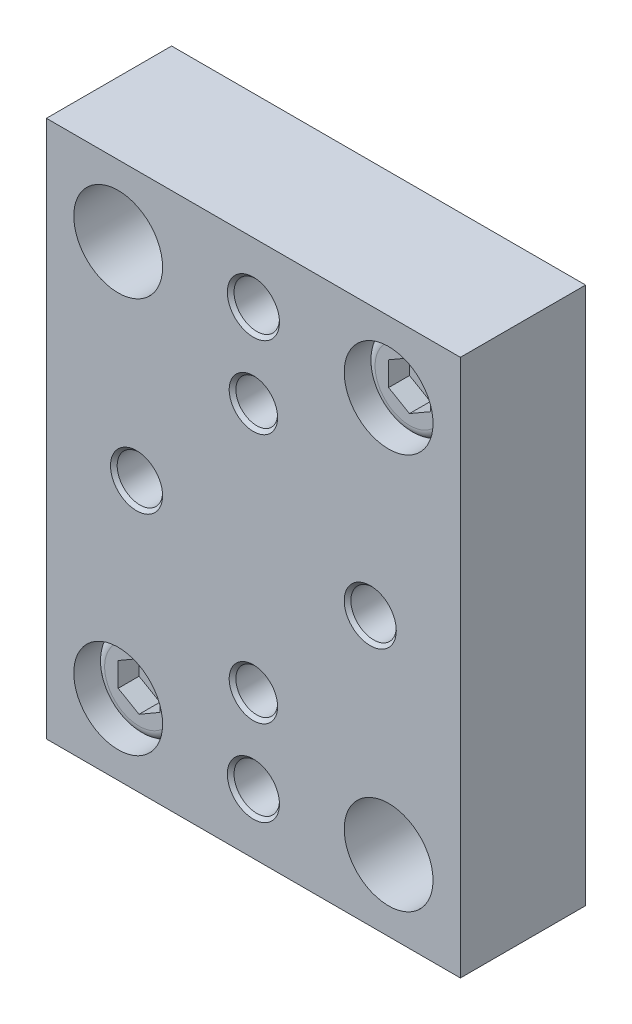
ISO-10303-21;
HEADER;
FILE_DESCRIPTION(('STEP AP214'),'2;1');
FILE_NAME('part.step','',(''),(''),'','','');
FILE_SCHEMA(('AUTOMOTIVE_DESIGN { 1 0 10303 214 1 1 1 1 }'));
ENDSEC;
DATA;
#1=APPLICATION_CONTEXT('core data for automotive mechanical design processes');
#2=APPLICATION_PROTOCOL_DEFINITION('international standard','automotive_design',2000,#1);
#3=PRODUCT_CONTEXT('',#1,'mechanical');
#4=PRODUCT('Part','Part','',(#3));
#5=PRODUCT_RELATED_PRODUCT_CATEGORY('part','',(#4));
#6=PRODUCT_DEFINITION_FORMATION('','',#4);
#7=PRODUCT_DEFINITION_CONTEXT('part definition',#1,'design');
#8=PRODUCT_DEFINITION('design','',#6,#7);
#9=PRODUCT_DEFINITION_SHAPE('','',#8);
#10=(LENGTH_UNIT() NAMED_UNIT(*) SI_UNIT(.MILLI.,.METRE.));
#11=(NAMED_UNIT(*) PLANE_ANGLE_UNIT() SI_UNIT($,.RADIAN.));
#12=(NAMED_UNIT(*) SI_UNIT($,.STERADIAN.) SOLID_ANGLE_UNIT());
#13=UNCERTAINTY_MEASURE_WITH_UNIT(LENGTH_MEASURE(1.E-05),#10,'distance_accuracy_value','');
#14=(GEOMETRIC_REPRESENTATION_CONTEXT(3) GLOBAL_UNCERTAINTY_ASSIGNED_CONTEXT((#13)) GLOBAL_UNIT_ASSIGNED_CONTEXT((#10,
#11,#12)) REPRESENTATION_CONTEXT('',''));
#15=CARTESIAN_POINT('',(0.,0.,0.));
#16=DIRECTION('',(0.,0.,1.));
#17=DIRECTION('',(1.,0.,0.));
#18=AXIS2_PLACEMENT_3D('',#15,#16,#17);
#19=CARTESIAN_POINT('',(-15.748,-20.447,7.9375));
#20=DIRECTION('',(0.,0.,1.));
#21=DIRECTION('',(1.,0.,0.));
#22=AXIS2_PLACEMENT_3D('',#19,#20,#21);
#23=PLANE('',#22);
#24=DIRECTION('',(-0.866025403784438,0.500000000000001,0.));
#25=VECTOR('',#24,1.);
#26=CARTESIAN_POINT('',(-8.6995,-14.1329564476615,7.9375));
#27=LINE('',#26,#25);
#28=CARTESIAN_POINT('',(-8.6995,-14.1329564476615,7.9375));
#29=VERTEX_POINT('',#28);
#30=CARTESIAN_POINT('',(-10.287,-13.2164128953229,7.9375));
#31=VERTEX_POINT('',#30);
#32=EDGE_CURVE('E60',#29,#31,#27,.T.);
#33=ORIENTED_EDGE('',*,*,#32,.F.);
#34=DIRECTION('',(0.,1.,0.));
#35=VECTOR('',#34,1.);
#36=CARTESIAN_POINT('',(-8.6995,-15.9660435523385,7.9375));
#37=LINE('',#36,#35);
#38=CARTESIAN_POINT('',(-8.6995,-15.9660435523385,7.9375));
#39=VERTEX_POINT('',#38);
#40=EDGE_CURVE('E143',#39,#29,#37,.T.);
#41=ORIENTED_EDGE('',*,*,#40,.F.);
#42=DIRECTION('',(0.86602540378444,0.499999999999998,0.));
#43=VECTOR('',#42,1.);
#44=CARTESIAN_POINT('',(-10.287,-16.8825871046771,7.9375));
#45=LINE('',#44,#43);
#46=CARTESIAN_POINT('',(-10.287,-16.8825871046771,7.9375));
#47=VERTEX_POINT('',#46);
#48=EDGE_CURVE('E141',#47,#39,#45,.T.);
#49=ORIENTED_EDGE('',*,*,#48,.F.);
#50=DIRECTION('',(0.86602540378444,-0.499999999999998,0.));
#51=VECTOR('',#50,1.);
#52=CARTESIAN_POINT('',(-11.8745,-15.9660435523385,7.9375));
#53=LINE('',#52,#51);
#54=CARTESIAN_POINT('',(-11.8745,-15.9660435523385,7.9375));
#55=VERTEX_POINT('',#54);
#56=EDGE_CURVE('E108',#55,#47,#53,.T.);
#57=ORIENTED_EDGE('',*,*,#56,.F.);
#58=DIRECTION('',(0.,-1.,0.));
#59=VECTOR('',#58,1.);
#60=CARTESIAN_POINT('',(-11.8745,-14.1329564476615,7.9375));
#61=LINE('',#60,#59);
#62=CARTESIAN_POINT('',(-11.8745,-14.1329564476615,7.9375));
#63=VERTEX_POINT('',#62);
#64=EDGE_CURVE('E137',#63,#55,#61,.T.);
#65=ORIENTED_EDGE('',*,*,#64,.F.);
#66=DIRECTION('',(-0.866025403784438,-0.500000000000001,0.));
#67=VECTOR('',#66,1.);
#68=CARTESIAN_POINT('',(-10.287,-13.2164128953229,7.9375));
#69=LINE('',#68,#67);
#70=EDGE_CURVE('E134',#31,#63,#69,.T.);
#71=ORIENTED_EDGE('',*,*,#70,.F.);
#72=EDGE_LOOP('',(#33,#41,#49,#57,#65,#71));
#73=FACE_BOUND('',#72,.T.);
#74=CARTESIAN_POINT('',(-10.287,-15.0495,7.9375));
#75=DIRECTION('',(0.,0.,1.));
#76=DIRECTION('',(1.,0.,0.));
#77=AXIS2_PLACEMENT_3D('',#74,#75,#76);
#78=CIRCLE('',#77,2.6162);
#79=CARTESIAN_POINT('',(-7.6708,-15.0495,7.9375));
#80=VERTEX_POINT('',#79);
#81=EDGE_CURVE('E12',#80,#80,#78,.T.);
#82=ORIENTED_EDGE('',*,*,#81,.T.);
#83=EDGE_LOOP('',(#82));
#84=FACE_BOUND('',#83,.T.);
#85=ADVANCED_FACE('F45',(#73,#84),#23,.T.);
#86=CARTESIAN_POINT('',(-10.287,-15.0495,0.));
#87=DIRECTION('',(0.,0.,-1.));
#88=DIRECTION('',(-1.,0.,0.));
#89=AXIS2_PLACEMENT_3D('',#86,#87,#88);
#90=PLANE('',#89);
#91=CARTESIAN_POINT('',(-10.287,-15.0495,0.));
#92=DIRECTION('',(0.,0.,-1.));
#93=DIRECTION('',(-1.,0.,0.));
#94=AXIS2_PLACEMENT_3D('',#91,#92,#93);
#95=CIRCLE('',#94,3.3782);
#96=CARTESIAN_POINT('',(-13.6652,-15.0495,0.));
#97=VERTEX_POINT('',#96);
#98=EDGE_CURVE('E147',#97,#97,#95,.T.);
#99=ORIENTED_EDGE('',*,*,#98,.T.);
#100=EDGE_LOOP('',(#99));
#101=FACE_BOUND('',#100,.T.);
#102=ADVANCED_FACE('F169',(#101),#90,.T.);
#103=CARTESIAN_POINT('',(-10.287,-15.0495,19.0799925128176));
#104=DIRECTION('',(0.,0.,-1.));
#105=DIRECTION('',(-1.,0.,0.));
#106=AXIS2_PLACEMENT_3D('',#103,#104,#105);
#107=CYLINDRICAL_SURFACE('',#106,3.3782);
#108=CARTESIAN_POINT('',(-10.287,-15.0495,7.1755));
#109=DIRECTION('',(0.,0.,1.));
#110=DIRECTION('',(1.,0.,0.));
#111=AXIS2_PLACEMENT_3D('',#108,#109,#110);
#112=CIRCLE('',#111,3.3782);
#113=CARTESIAN_POINT('',(-6.9088,-15.0495,7.1755));
#114=VERTEX_POINT('',#113);
#115=EDGE_CURVE('E53',#114,#114,#112,.F.);
#116=ORIENTED_EDGE('',*,*,#115,.T.);
#117=EDGE_LOOP('',(#116));
#118=FACE_BOUND('',#117,.T.);
#119=ORIENTED_EDGE('',*,*,#98,.F.);
#120=EDGE_LOOP('',(#119));
#121=FACE_BOUND('',#120,.T.);
#122=ADVANCED_FACE('F157',(#118,#121),#107,.T.);
#123=CARTESIAN_POINT('',(-10.287,-15.0495,7.1755));
#124=DIRECTION('',(0.,0.,1.));
#125=DIRECTION('',(1.,0.,0.));
#126=AXIS2_PLACEMENT_3D('',#123,#124,#125);
#127=TOROIDAL_SURFACE('',#126,2.6162,0.762);
#128=ORIENTED_EDGE('',*,*,#81,.F.);
#129=EDGE_LOOP('',(#128));
#130=FACE_BOUND('',#129,.T.);
#131=ORIENTED_EDGE('',*,*,#115,.F.);
#132=EDGE_LOOP('',(#131));
#133=FACE_BOUND('',#132,.T.);
#134=ADVANCED_FACE('F47',(#130,#133),#127,.T.);
#135=CARTESIAN_POINT('',(-8.6995,-14.1329564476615,6.35));
#136=DIRECTION('',(0.500000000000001,0.866025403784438,0.));
#137=DIRECTION('',(-0.866025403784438,0.500000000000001,0.));
#138=AXIS2_PLACEMENT_3D('',#135,#136,#137);
#139=PLANE('',#138);
#140=ORIENTED_EDGE('',*,*,#32,.T.);
#141=DIRECTION('',(0.,0.,1.));
#142=VECTOR('',#141,1.);
#143=CARTESIAN_POINT('',(-10.287,-13.2164128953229,6.35));
#144=LINE('',#143,#142);
#145=CARTESIAN_POINT('',(-10.287,-13.2164128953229,6.35));
#146=VERTEX_POINT('',#145);
#147=EDGE_CURVE('E90',#146,#31,#144,.T.);
#148=ORIENTED_EDGE('',*,*,#147,.F.);
#149=DIRECTION('',(-0.866025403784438,0.500000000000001,0.));
#150=VECTOR('',#149,1.);
#151=CARTESIAN_POINT('',(-8.6995,-14.1329564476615,6.35));
#152=LINE('',#151,#150);
#153=CARTESIAN_POINT('',(-8.6995,-14.1329564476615,6.35));
#154=VERTEX_POINT('',#153);
#155=EDGE_CURVE('E145',#154,#146,#152,.T.);
#156=ORIENTED_EDGE('',*,*,#155,.F.);
#157=DIRECTION('',(0.,0.,1.));
#158=VECTOR('',#157,1.);
#159=CARTESIAN_POINT('',(-8.6995,-14.1329564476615,6.35));
#160=LINE('',#159,#158);
#161=EDGE_CURVE('E68',#154,#29,#160,.T.);
#162=ORIENTED_EDGE('',*,*,#161,.T.);
#163=EDGE_LOOP('',(#140,#148,#156,#162));
#164=FACE_BOUND('',#163,.T.);
#165=ADVANCED_FACE('F161',(#164),#139,.F.);
#166=CARTESIAN_POINT('',(-8.6995,-15.9660435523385,6.35));
#167=DIRECTION('',(1.,0.,0.));
#168=DIRECTION('',(0.,0.,-1.));
#169=AXIS2_PLACEMENT_3D('',#166,#167,#168);
#170=PLANE('',#169);
#171=ORIENTED_EDGE('',*,*,#40,.T.);
#172=ORIENTED_EDGE('',*,*,#161,.F.);
#173=DIRECTION('',(0.,1.,0.));
#174=VECTOR('',#173,1.);
#175=CARTESIAN_POINT('',(-8.6995,-15.9660435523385,6.35));
#176=LINE('',#175,#174);
#177=CARTESIAN_POINT('',(-8.6995,-15.9660435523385,6.35));
#178=VERTEX_POINT('',#177);
#179=EDGE_CURVE('E120',#178,#154,#176,.T.);
#180=ORIENTED_EDGE('',*,*,#179,.F.);
#181=DIRECTION('',(0.,0.,1.));
#182=VECTOR('',#181,1.);
#183=CARTESIAN_POINT('',(-8.6995,-15.9660435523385,6.35));
#184=LINE('',#183,#182);
#185=EDGE_CURVE('E112',#178,#39,#184,.T.);
#186=ORIENTED_EDGE('',*,*,#185,.T.);
#187=EDGE_LOOP('',(#171,#172,#180,#186));
#188=FACE_BOUND('',#187,.T.);
#189=ADVANCED_FACE('F167',(#188),#170,.F.);
#190=CARTESIAN_POINT('',(-10.287,-16.8825871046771,6.35));
#191=DIRECTION('',(0.499999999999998,-0.86602540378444,0.));
#192=DIRECTION('',(0.86602540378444,0.499999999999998,0.));
#193=AXIS2_PLACEMENT_3D('',#190,#191,#192);
#194=PLANE('',#193);
#195=ORIENTED_EDGE('',*,*,#48,.T.);
#196=ORIENTED_EDGE('',*,*,#185,.F.);
#197=DIRECTION('',(0.86602540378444,0.499999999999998,0.));
#198=VECTOR('',#197,1.);
#199=CARTESIAN_POINT('',(-10.287,-16.8825871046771,6.35));
#200=LINE('',#199,#198);
#201=CARTESIAN_POINT('',(-10.287,-16.8825871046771,6.35));
#202=VERTEX_POINT('',#201);
#203=EDGE_CURVE('E116',#202,#178,#200,.T.);
#204=ORIENTED_EDGE('',*,*,#203,.F.);
#205=DIRECTION('',(0.,0.,1.));
#206=VECTOR('',#205,1.);
#207=CARTESIAN_POINT('',(-10.287,-16.8825871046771,6.35));
#208=LINE('',#207,#206);
#209=EDGE_CURVE('E101',#202,#47,#208,.T.);
#210=ORIENTED_EDGE('',*,*,#209,.T.);
#211=EDGE_LOOP('',(#195,#196,#204,#210));
#212=FACE_BOUND('',#211,.T.);
#213=ADVANCED_FACE('F117',(#212),#194,.F.);
#214=CARTESIAN_POINT('',(-11.8745,-15.9660435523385,6.35));
#215=DIRECTION('',(-0.499999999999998,-0.86602540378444,0.));
#216=DIRECTION('',(0.86602540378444,-0.499999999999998,0.));
#217=AXIS2_PLACEMENT_3D('',#214,#215,#216);
#218=PLANE('',#217);
#219=ORIENTED_EDGE('',*,*,#56,.T.);
#220=ORIENTED_EDGE('',*,*,#209,.F.);
#221=DIRECTION('',(0.86602540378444,-0.499999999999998,0.));
#222=VECTOR('',#221,1.);
#223=CARTESIAN_POINT('',(-11.8745,-15.9660435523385,6.35));
#224=LINE('',#223,#222);
#225=CARTESIAN_POINT('',(-11.8745,-15.9660435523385,6.35));
#226=VERTEX_POINT('',#225);
#227=EDGE_CURVE('E105',#226,#202,#224,.T.);
#228=ORIENTED_EDGE('',*,*,#227,.F.);
#229=DIRECTION('',(0.,0.,1.));
#230=VECTOR('',#229,1.);
#231=CARTESIAN_POINT('',(-11.8745,-15.9660435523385,6.35));
#232=LINE('',#231,#230);
#233=EDGE_CURVE('E113',#226,#55,#232,.T.);
#234=ORIENTED_EDGE('',*,*,#233,.T.);
#235=EDGE_LOOP('',(#219,#220,#228,#234));
#236=FACE_BOUND('',#235,.T.);
#237=ADVANCED_FACE('F103',(#236),#218,.F.);
#238=CARTESIAN_POINT('',(-11.8745,-14.1329564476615,6.35));
#239=DIRECTION('',(-1.,0.,0.));
#240=DIRECTION('',(0.,-1.,0.));
#241=AXIS2_PLACEMENT_3D('',#238,#239,#240);
#242=PLANE('',#241);
#243=ORIENTED_EDGE('',*,*,#64,.T.);
#244=ORIENTED_EDGE('',*,*,#233,.F.);
#245=DIRECTION('',(0.,-1.,0.));
#246=VECTOR('',#245,1.);
#247=CARTESIAN_POINT('',(-11.8745,-14.1329564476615,6.35));
#248=LINE('',#247,#246);
#249=CARTESIAN_POINT('',(-11.8745,-14.1329564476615,6.35));
#250=VERTEX_POINT('',#249);
#251=EDGE_CURVE('E126',#250,#226,#248,.T.);
#252=ORIENTED_EDGE('',*,*,#251,.F.);
#253=DIRECTION('',(0.,0.,1.));
#254=VECTOR('',#253,1.);
#255=CARTESIAN_POINT('',(-11.8745,-14.1329564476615,6.35));
#256=LINE('',#255,#254);
#257=EDGE_CURVE('E150',#250,#63,#256,.T.);
#258=ORIENTED_EDGE('',*,*,#257,.T.);
#259=EDGE_LOOP('',(#243,#244,#252,#258));
#260=FACE_BOUND('',#259,.T.);
#261=ADVANCED_FACE('F184',(#260),#242,.F.);
#262=CARTESIAN_POINT('',(-10.287,-13.2164128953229,6.35));
#263=DIRECTION('',(-0.500000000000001,0.866025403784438,0.));
#264=DIRECTION('',(-0.866025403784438,-0.500000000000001,0.));
#265=AXIS2_PLACEMENT_3D('',#262,#263,#264);
#266=PLANE('',#265);
#267=ORIENTED_EDGE('',*,*,#70,.T.);
#268=ORIENTED_EDGE('',*,*,#257,.F.);
#269=DIRECTION('',(-0.866025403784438,-0.500000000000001,0.));
#270=VECTOR('',#269,1.);
#271=CARTESIAN_POINT('',(-10.287,-13.2164128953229,6.35));
#272=LINE('',#271,#270);
#273=EDGE_CURVE('E128',#146,#250,#272,.T.);
#274=ORIENTED_EDGE('',*,*,#273,.F.);
#275=ORIENTED_EDGE('',*,*,#147,.T.);
#276=EDGE_LOOP('',(#267,#268,#274,#275));
#277=FACE_BOUND('',#276,.T.);
#278=ADVANCED_FACE('F181',(#277),#266,.F.);
#279=CARTESIAN_POINT('',(0.,0.,6.35));
#280=DIRECTION('',(0.,0.,1.));
#281=DIRECTION('',(1.,0.,0.));
#282=AXIS2_PLACEMENT_3D('',#279,#280,#281);
#283=PLANE('',#282);
#284=ORIENTED_EDGE('',*,*,#155,.T.);
#285=ORIENTED_EDGE('',*,*,#273,.T.);
#286=ORIENTED_EDGE('',*,*,#251,.T.);
#287=ORIENTED_EDGE('',*,*,#227,.T.);
#288=ORIENTED_EDGE('',*,*,#203,.T.);
#289=ORIENTED_EDGE('',*,*,#179,.T.);
#290=EDGE_LOOP('',(#284,#285,#286,#287,#288,#289));
#291=FACE_BOUND('',#290,.T.);
#292=ADVANCED_FACE('F123',(#291),#283,.T.);
#293=CLOSED_SHELL('',(#85,#102,#122,#134,#165,#189,#213,#237,#261,#278,#292));
#294=MANIFOLD_SOLID_BREP('B2',#293);
#295=CARTESIAN_POINT('',(-15.748,-20.447,7.9375));
#296=DIRECTION('',(0.,0.,1.));
#297=DIRECTION('',(1.,0.,0.));
#298=AXIS2_PLACEMENT_3D('',#295,#296,#297);
#299=PLANE('',#298);
#300=DIRECTION('',(-0.866025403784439,0.5,0.));
#301=VECTOR('',#300,1.);
#302=CARTESIAN_POINT('',(11.8745,15.9660435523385,7.9375));
#303=LINE('',#302,#301);
#304=CARTESIAN_POINT('',(11.8745,15.9660435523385,7.9375));
#305=VERTEX_POINT('',#304);
#306=CARTESIAN_POINT('',(10.287,16.8825871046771,7.9375));
#307=VERTEX_POINT('',#306);
#308=EDGE_CURVE('E290',#305,#307,#303,.T.);
#309=ORIENTED_EDGE('',*,*,#308,.F.);
#310=DIRECTION('',(0.,1.,0.));
#311=VECTOR('',#310,1.);
#312=CARTESIAN_POINT('',(11.8745,14.1329564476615,7.9375));
#313=LINE('',#312,#311);
#314=CARTESIAN_POINT('',(11.8745,14.1329564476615,7.9375));
#315=VERTEX_POINT('',#314);
#316=EDGE_CURVE('E373',#315,#305,#313,.T.);
#317=ORIENTED_EDGE('',*,*,#316,.F.);
#318=DIRECTION('',(0.866025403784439,0.5,0.));
#319=VECTOR('',#318,1.);
#320=CARTESIAN_POINT('',(10.287,13.2164128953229,7.9375));
#321=LINE('',#320,#319);
#322=CARTESIAN_POINT('',(10.287,13.2164128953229,7.9375));
#323=VERTEX_POINT('',#322);
#324=EDGE_CURVE('E371',#323,#315,#321,.T.);
#325=ORIENTED_EDGE('',*,*,#324,.F.);
#326=DIRECTION('',(0.866025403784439,-0.5,0.));
#327=VECTOR('',#326,1.);
#328=CARTESIAN_POINT('',(8.6995,14.1329564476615,7.9375));
#329=LINE('',#328,#327);
#330=CARTESIAN_POINT('',(8.6995,14.1329564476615,7.9375));
#331=VERTEX_POINT('',#330);
#332=EDGE_CURVE('E338',#331,#323,#329,.T.);
#333=ORIENTED_EDGE('',*,*,#332,.F.);
#334=DIRECTION('',(0.,-1.,0.));
#335=VECTOR('',#334,1.);
#336=CARTESIAN_POINT('',(8.6995,15.9660435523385,7.9375));
#337=LINE('',#336,#335);
#338=CARTESIAN_POINT('',(8.6995,15.9660435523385,7.9375));
#339=VERTEX_POINT('',#338);
#340=EDGE_CURVE('E367',#339,#331,#337,.T.);
#341=ORIENTED_EDGE('',*,*,#340,.F.);
#342=DIRECTION('',(-0.866025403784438,-0.5,0.));
#343=VECTOR('',#342,1.);
#344=CARTESIAN_POINT('',(10.287,16.8825871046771,7.9375));
#345=LINE('',#344,#343);
#346=EDGE_CURVE('E364',#307,#339,#345,.T.);
#347=ORIENTED_EDGE('',*,*,#346,.F.);
#348=EDGE_LOOP('',(#309,#317,#325,#333,#341,#347));
#349=FACE_BOUND('',#348,.T.);
#350=CARTESIAN_POINT('',(10.287,15.0495,7.9375));
#351=DIRECTION('',(0.,0.,1.));
#352=DIRECTION('',(1.,0.,0.));
#353=AXIS2_PLACEMENT_3D('',#350,#351,#352);
#354=CIRCLE('',#353,2.6162);
#355=CARTESIAN_POINT('',(12.9032,15.0495,7.9375));
#356=VERTEX_POINT('',#355);
#357=EDGE_CURVE('E43',#356,#356,#354,.T.);
#358=ORIENTED_EDGE('',*,*,#357,.T.);
#359=EDGE_LOOP('',(#358));
#360=FACE_BOUND('',#359,.T.);
#361=ADVANCED_FACE('F275',(#349,#360),#299,.T.);
#362=CARTESIAN_POINT('',(10.287,15.0495,0.));
#363=DIRECTION('',(0.,0.,-1.));
#364=DIRECTION('',(-1.,0.,0.));
#365=AXIS2_PLACEMENT_3D('',#362,#363,#364);
#366=PLANE('',#365);
#367=CARTESIAN_POINT('',(10.287,15.0495,0.));
#368=DIRECTION('',(0.,0.,-1.));
#369=DIRECTION('',(-1.,0.,0.));
#370=AXIS2_PLACEMENT_3D('',#367,#368,#369);
#371=CIRCLE('',#370,3.3782);
#372=CARTESIAN_POINT('',(6.9088,15.0495,0.));
#373=VERTEX_POINT('',#372);
#374=EDGE_CURVE('E377',#373,#373,#371,.T.);
#375=ORIENTED_EDGE('',*,*,#374,.T.);
#376=EDGE_LOOP('',(#375));
#377=FACE_BOUND('',#376,.T.);
#378=ADVANCED_FACE('F399',(#377),#366,.T.);
#379=CARTESIAN_POINT('',(10.287,15.0495,19.0799925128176));
#380=DIRECTION('',(0.,0.,-1.));
#381=DIRECTION('',(-1.,0.,0.));
#382=AXIS2_PLACEMENT_3D('',#379,#380,#381);
#383=CYLINDRICAL_SURFACE('',#382,3.3782);
#384=CARTESIAN_POINT('',(10.287,15.0495,7.1755));
#385=DIRECTION('',(0.,0.,1.));
#386=DIRECTION('',(1.,0.,0.));
#387=AXIS2_PLACEMENT_3D('',#384,#385,#386);
#388=CIRCLE('',#387,3.3782);
#389=CARTESIAN_POINT('',(13.6652,15.0495,7.1755));
#390=VERTEX_POINT('',#389);
#391=EDGE_CURVE('E283',#390,#390,#388,.F.);
#392=ORIENTED_EDGE('',*,*,#391,.T.);
#393=EDGE_LOOP('',(#392));
#394=FACE_BOUND('',#393,.T.);
#395=ORIENTED_EDGE('',*,*,#374,.F.);
#396=EDGE_LOOP('',(#395));
#397=FACE_BOUND('',#396,.T.);
#398=ADVANCED_FACE('F387',(#394,#397),#383,.T.);
#399=CARTESIAN_POINT('',(10.287,15.0495,7.1755));
#400=DIRECTION('',(0.,0.,1.));
#401=DIRECTION('',(1.,0.,0.));
#402=AXIS2_PLACEMENT_3D('',#399,#400,#401);
#403=TOROIDAL_SURFACE('',#402,2.6162,0.762);
#404=ORIENTED_EDGE('',*,*,#357,.F.);
#405=EDGE_LOOP('',(#404));
#406=FACE_BOUND('',#405,.T.);
#407=ORIENTED_EDGE('',*,*,#391,.F.);
#408=EDGE_LOOP('',(#407));
#409=FACE_BOUND('',#408,.T.);
#410=ADVANCED_FACE('F277',(#406,#409),#403,.T.);
#411=CARTESIAN_POINT('',(11.8745,15.9660435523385,6.35));
#412=DIRECTION('',(0.5,0.866025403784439,0.));
#413=DIRECTION('',(-0.866025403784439,0.5,0.));
#414=AXIS2_PLACEMENT_3D('',#411,#412,#413);
#415=PLANE('',#414);
#416=ORIENTED_EDGE('',*,*,#308,.T.);
#417=DIRECTION('',(0.,0.,1.));
#418=VECTOR('',#417,1.);
#419=CARTESIAN_POINT('',(10.287,16.8825871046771,6.35));
#420=LINE('',#419,#418);
#421=CARTESIAN_POINT('',(10.287,16.8825871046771,6.35));
#422=VERTEX_POINT('',#421);
#423=EDGE_CURVE('E320',#422,#307,#420,.T.);
#424=ORIENTED_EDGE('',*,*,#423,.F.);
#425=DIRECTION('',(-0.866025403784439,0.5,0.));
#426=VECTOR('',#425,1.);
#427=CARTESIAN_POINT('',(11.8745,15.9660435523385,6.35));
#428=LINE('',#427,#426);
#429=CARTESIAN_POINT('',(11.8745,15.9660435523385,6.35));
#430=VERTEX_POINT('',#429);
#431=EDGE_CURVE('E375',#430,#422,#428,.T.);
#432=ORIENTED_EDGE('',*,*,#431,.F.);
#433=DIRECTION('',(0.,0.,1.));
#434=VECTOR('',#433,1.);
#435=CARTESIAN_POINT('',(11.8745,15.9660435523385,6.35));
#436=LINE('',#435,#434);
#437=EDGE_CURVE('E298',#430,#305,#436,.T.);
#438=ORIENTED_EDGE('',*,*,#437,.T.);
#439=EDGE_LOOP('',(#416,#424,#432,#438));
#440=FACE_BOUND('',#439,.T.);
#441=ADVANCED_FACE('F391',(#440),#415,.F.);
#442=CARTESIAN_POINT('',(11.8745,14.1329564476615,6.35));
#443=DIRECTION('',(1.,0.,0.));
#444=DIRECTION('',(0.,1.,0.));
#445=AXIS2_PLACEMENT_3D('',#442,#443,#444);
#446=PLANE('',#445);
#447=ORIENTED_EDGE('',*,*,#316,.T.);
#448=ORIENTED_EDGE('',*,*,#437,.F.);
#449=DIRECTION('',(0.,1.,0.));
#450=VECTOR('',#449,1.);
#451=CARTESIAN_POINT('',(11.8745,14.1329564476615,6.35));
#452=LINE('',#451,#450);
#453=CARTESIAN_POINT('',(11.8745,14.1329564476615,6.35));
#454=VERTEX_POINT('',#453);
#455=EDGE_CURVE('E350',#454,#430,#452,.T.);
#456=ORIENTED_EDGE('',*,*,#455,.F.);
#457=DIRECTION('',(0.,0.,1.));
#458=VECTOR('',#457,1.);
#459=CARTESIAN_POINT('',(11.8745,14.1329564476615,6.35));
#460=LINE('',#459,#458);
#461=EDGE_CURVE('E342',#454,#315,#460,.T.);
#462=ORIENTED_EDGE('',*,*,#461,.T.);
#463=EDGE_LOOP('',(#447,#448,#456,#462));
#464=FACE_BOUND('',#463,.T.);
#465=ADVANCED_FACE('F397',(#464),#446,.F.);
#466=CARTESIAN_POINT('',(10.287,13.2164128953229,6.35));
#467=DIRECTION('',(0.5,-0.866025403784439,0.));
#468=DIRECTION('',(0.866025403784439,0.5,0.));
#469=AXIS2_PLACEMENT_3D('',#466,#467,#468);
#470=PLANE('',#469);
#471=ORIENTED_EDGE('',*,*,#324,.T.);
#472=ORIENTED_EDGE('',*,*,#461,.F.);
#473=DIRECTION('',(0.866025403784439,0.5,0.));
#474=VECTOR('',#473,1.);
#475=CARTESIAN_POINT('',(10.287,13.2164128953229,6.35));
#476=LINE('',#475,#474);
#477=CARTESIAN_POINT('',(10.287,13.2164128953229,6.35));
#478=VERTEX_POINT('',#477);
#479=EDGE_CURVE('E346',#478,#454,#476,.T.);
#480=ORIENTED_EDGE('',*,*,#479,.F.);
#481=DIRECTION('',(0.,0.,1.));
#482=VECTOR('',#481,1.);
#483=CARTESIAN_POINT('',(10.287,13.2164128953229,6.35));
#484=LINE('',#483,#482);
#485=EDGE_CURVE('E331',#478,#323,#484,.T.);
#486=ORIENTED_EDGE('',*,*,#485,.T.);
#487=EDGE_LOOP('',(#471,#472,#480,#486));
#488=FACE_BOUND('',#487,.T.);
#489=ADVANCED_FACE('F347',(#488),#470,.F.);
#490=CARTESIAN_POINT('',(8.6995,14.1329564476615,6.35));
#491=DIRECTION('',(-0.5,-0.866025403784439,0.));
#492=DIRECTION('',(0.866025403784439,-0.5,0.));
#493=AXIS2_PLACEMENT_3D('',#490,#491,#492);
#494=PLANE('',#493);
#495=ORIENTED_EDGE('',*,*,#332,.T.);
#496=ORIENTED_EDGE('',*,*,#485,.F.);
#497=DIRECTION('',(0.866025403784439,-0.5,0.));
#498=VECTOR('',#497,1.);
#499=CARTESIAN_POINT('',(8.6995,14.1329564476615,6.35));
#500=LINE('',#499,#498);
#501=CARTESIAN_POINT('',(8.6995,14.1329564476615,6.35));
#502=VERTEX_POINT('',#501);
#503=EDGE_CURVE('E335',#502,#478,#500,.T.);
#504=ORIENTED_EDGE('',*,*,#503,.F.);
#505=DIRECTION('',(0.,0.,1.));
#506=VECTOR('',#505,1.);
#507=CARTESIAN_POINT('',(8.6995,14.1329564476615,6.35));
#508=LINE('',#507,#506);
#509=EDGE_CURVE('E343',#502,#331,#508,.T.);
#510=ORIENTED_EDGE('',*,*,#509,.T.);
#511=EDGE_LOOP('',(#495,#496,#504,#510));
#512=FACE_BOUND('',#511,.T.);
#513=ADVANCED_FACE('F333',(#512),#494,.F.);
#514=CARTESIAN_POINT('',(8.6995,15.9660435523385,6.35));
#515=DIRECTION('',(-1.,0.,0.));
#516=DIRECTION('',(0.,0.,1.));
#517=AXIS2_PLACEMENT_3D('',#514,#515,#516);
#518=PLANE('',#517);
#519=ORIENTED_EDGE('',*,*,#340,.T.);
#520=ORIENTED_EDGE('',*,*,#509,.F.);
#521=DIRECTION('',(0.,-1.,0.));
#522=VECTOR('',#521,1.);
#523=CARTESIAN_POINT('',(8.6995,15.9660435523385,6.35));
#524=LINE('',#523,#522);
#525=CARTESIAN_POINT('',(8.6995,15.9660435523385,6.35));
#526=VERTEX_POINT('',#525);
#527=EDGE_CURVE('E356',#526,#502,#524,.T.);
#528=ORIENTED_EDGE('',*,*,#527,.F.);
#529=DIRECTION('',(0.,0.,1.));
#530=VECTOR('',#529,1.);
#531=CARTESIAN_POINT('',(8.6995,15.9660435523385,6.35));
#532=LINE('',#531,#530);
#533=EDGE_CURVE('E380',#526,#339,#532,.T.);
#534=ORIENTED_EDGE('',*,*,#533,.T.);
#535=EDGE_LOOP('',(#519,#520,#528,#534));
#536=FACE_BOUND('',#535,.T.);
#537=ADVANCED_FACE('F414',(#536),#518,.F.);
#538=CARTESIAN_POINT('',(10.287,16.8825871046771,6.35));
#539=DIRECTION('',(-0.5,0.866025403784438,0.));
#540=DIRECTION('',(-0.866025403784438,-0.5,0.));
#541=AXIS2_PLACEMENT_3D('',#538,#539,#540);
#542=PLANE('',#541);
#543=ORIENTED_EDGE('',*,*,#346,.T.);
#544=ORIENTED_EDGE('',*,*,#533,.F.);
#545=DIRECTION('',(-0.866025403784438,-0.5,0.));
#546=VECTOR('',#545,1.);
#547=CARTESIAN_POINT('',(10.287,16.8825871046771,6.35));
#548=LINE('',#547,#546);
#549=EDGE_CURVE('E358',#422,#526,#548,.T.);
#550=ORIENTED_EDGE('',*,*,#549,.F.);
#551=ORIENTED_EDGE('',*,*,#423,.T.);
#552=EDGE_LOOP('',(#543,#544,#550,#551));
#553=FACE_BOUND('',#552,.T.);
#554=ADVANCED_FACE('F411',(#553),#542,.F.);
#555=CARTESIAN_POINT('',(0.,0.,6.35));
#556=DIRECTION('',(0.,0.,1.));
#557=DIRECTION('',(1.,0.,0.));
#558=AXIS2_PLACEMENT_3D('',#555,#556,#557);
#559=PLANE('',#558);
#560=ORIENTED_EDGE('',*,*,#431,.T.);
#561=ORIENTED_EDGE('',*,*,#549,.T.);
#562=ORIENTED_EDGE('',*,*,#527,.T.);
#563=ORIENTED_EDGE('',*,*,#503,.T.);
#564=ORIENTED_EDGE('',*,*,#479,.T.);
#565=ORIENTED_EDGE('',*,*,#455,.T.);
#566=EDGE_LOOP('',(#560,#561,#562,#563,#564,#565));
#567=FACE_BOUND('',#566,.T.);
#568=ADVANCED_FACE('F353',(#567),#559,.T.);
#569=CLOSED_SHELL('',(#361,#378,#398,#410,#441,#465,#489,#513,#537,#554,#568));
#570=MANIFOLD_SOLID_BREP('B6',#569);
#571=CARTESIAN_POINT('',(-15.748,20.447,9.525));
#572=DIRECTION('',(1.,0.,0.));
#573=DIRECTION('',(0.,1.,0.));
#574=AXIS2_PLACEMENT_3D('',#571,#572,#573);
#575=PLANE('',#574);
#576=DIRECTION('',(0.,-1.,0.));
#577=VECTOR('',#576,1.);
#578=CARTESIAN_POINT('',(-15.748,20.447,0.));
#579=LINE('',#578,#577);
#580=CARTESIAN_POINT('',(-15.748,20.447,0.));
#581=VERTEX_POINT('',#580);
#582=CARTESIAN_POINT('',(-15.748,-20.447,0.));
#583=VERTEX_POINT('',#582);
#584=EDGE_CURVE('E564',#581,#583,#579,.T.);
#585=ORIENTED_EDGE('',*,*,#584,.T.);
#586=DIRECTION('',(0.,0.,-1.));
#587=VECTOR('',#586,1.);
#588=CARTESIAN_POINT('',(-15.748,-20.447,9.525));
#589=LINE('',#588,#587);
#590=CARTESIAN_POINT('',(-15.748,-20.447,9.525));
#591=VERTEX_POINT('',#590);
#592=EDGE_CURVE('E555',#591,#583,#589,.T.);
#593=ORIENTED_EDGE('',*,*,#592,.F.);
#594=DIRECTION('',(0.,-1.,0.));
#595=VECTOR('',#594,1.);
#596=CARTESIAN_POINT('',(-15.748,20.447,9.525));
#597=LINE('',#596,#595);
#598=CARTESIAN_POINT('',(-15.748,20.447,9.525));
#599=VERTEX_POINT('',#598);
#600=EDGE_CURVE('E549',#599,#591,#597,.T.);
#601=ORIENTED_EDGE('',*,*,#600,.F.);
#602=DIRECTION('',(0.,0.,-1.));
#603=VECTOR('',#602,1.);
#604=CARTESIAN_POINT('',(-15.748,20.447,9.525));
#605=LINE('',#604,#603);
#606=EDGE_CURVE('E560',#599,#581,#605,.T.);
#607=ORIENTED_EDGE('',*,*,#606,.T.);
#608=EDGE_LOOP('',(#585,#593,#601,#607));
#609=FACE_BOUND('',#608,.T.);
#610=ADVANCED_FACE('F496',(#609),#575,.F.);
#611=CARTESIAN_POINT('',(-15.748,-20.447,9.525));
#612=DIRECTION('',(0.,1.,0.));
#613=DIRECTION('',(0.,0.,1.));
#614=AXIS2_PLACEMENT_3D('',#611,#612,#613);
#615=PLANE('',#614);
#616=DIRECTION('',(1.,0.,0.));
#617=VECTOR('',#616,1.);
#618=CARTESIAN_POINT('',(-15.748,-20.447,0.));
#619=LINE('',#618,#617);
#620=CARTESIAN_POINT('',(15.748,-20.447,0.));
#621=VERTEX_POINT('',#620);
#622=EDGE_CURVE('E554',#583,#621,#619,.T.);
#623=ORIENTED_EDGE('',*,*,#622,.T.);
#624=DIRECTION('',(0.,0.,-1.));
#625=VECTOR('',#624,1.);
#626=CARTESIAN_POINT('',(15.748,-20.447,9.525));
#627=LINE('',#626,#625);
#628=CARTESIAN_POINT('',(15.748,-20.447,9.525));
#629=VERTEX_POINT('',#628);
#630=EDGE_CURVE('E552',#629,#621,#627,.T.);
#631=ORIENTED_EDGE('',*,*,#630,.F.);
#632=DIRECTION('',(1.,0.,0.));
#633=VECTOR('',#632,1.);
#634=CARTESIAN_POINT('',(-15.748,-20.447,9.525));
#635=LINE('',#634,#633);
#636=EDGE_CURVE('E544',#591,#629,#635,.T.);
#637=ORIENTED_EDGE('',*,*,#636,.F.);
#638=ORIENTED_EDGE('',*,*,#592,.T.);
#639=EDGE_LOOP('',(#623,#631,#637,#638));
#640=FACE_BOUND('',#639,.T.);
#641=ADVANCED_FACE('F553',(#640),#615,.F.);
#642=CARTESIAN_POINT('',(15.748,20.447,9.525));
#643=DIRECTION('',(-1.,0.,0.));
#644=DIRECTION('',(0.,-1.,0.));
#645=AXIS2_PLACEMENT_3D('',#642,#643,#644);
#646=PLANE('',#645);
#647=DIRECTION('',(0.,1.,0.));
#648=VECTOR('',#647,1.);
#649=CARTESIAN_POINT('',(15.748,20.447,0.));
#650=LINE('',#649,#648);
#651=CARTESIAN_POINT('',(15.748,20.447,0.));
#652=VERTEX_POINT('',#651);
#653=EDGE_CURVE('E530',#621,#652,#650,.T.);
#654=ORIENTED_EDGE('',*,*,#653,.T.);
#655=DIRECTION('',(0.,0.,-1.));
#656=VECTOR('',#655,1.);
#657=CARTESIAN_POINT('',(15.748,20.447,9.525));
#658=LINE('',#657,#656);
#659=CARTESIAN_POINT('',(15.748,20.447,9.525));
#660=VERTEX_POINT('',#659);
#661=EDGE_CURVE('E556',#660,#652,#658,.T.);
#662=ORIENTED_EDGE('',*,*,#661,.F.);
#663=DIRECTION('',(0.,1.,0.));
#664=VECTOR('',#663,1.);
#665=CARTESIAN_POINT('',(15.748,20.447,9.525));
#666=LINE('',#665,#664);
#667=EDGE_CURVE('E547',#629,#660,#666,.T.);
#668=ORIENTED_EDGE('',*,*,#667,.F.);
#669=ORIENTED_EDGE('',*,*,#630,.T.);
#670=EDGE_LOOP('',(#654,#662,#668,#669));
#671=FACE_BOUND('',#670,.T.);
#672=ADVANCED_FACE('F558',(#671),#646,.F.);
#673=CARTESIAN_POINT('',(-15.748,20.447,9.525));
#674=DIRECTION('',(0.,-1.,0.));
#675=DIRECTION('',(0.,0.,-1.));
#676=AXIS2_PLACEMENT_3D('',#673,#674,#675);
#677=PLANE('',#676);
#678=DIRECTION('',(-1.,0.,0.));
#679=VECTOR('',#678,1.);
#680=CARTESIAN_POINT('',(-15.748,20.447,0.));
#681=LINE('',#680,#679);
#682=EDGE_CURVE('E536',#652,#581,#681,.T.);
#683=ORIENTED_EDGE('',*,*,#682,.T.);
#684=ORIENTED_EDGE('',*,*,#606,.F.);
#685=DIRECTION('',(-1.,0.,0.));
#686=VECTOR('',#685,1.);
#687=CARTESIAN_POINT('',(-15.748,20.447,9.525));
#688=LINE('',#687,#686);
#689=EDGE_CURVE('E513',#660,#599,#688,.T.);
#690=ORIENTED_EDGE('',*,*,#689,.F.);
#691=ORIENTED_EDGE('',*,*,#661,.T.);
#692=EDGE_LOOP('',(#683,#684,#690,#691));
#693=FACE_BOUND('',#692,.T.);
#694=ADVANCED_FACE('F710',(#693),#677,.F.);
#695=CARTESIAN_POINT('',(-15.748,-20.447,9.525));
#696=DIRECTION('',(0.,0.,1.));
#697=DIRECTION('',(1.,0.,0.));
#698=AXIS2_PLACEMENT_3D('',#695,#696,#697);
#699=PLANE('',#698);
#700=CARTESIAN_POINT('',(-8.89,0.,9.525));
#701=DIRECTION('',(0.,0.,1.));
#702=DIRECTION('',(1.,0.,0.));
#703=AXIS2_PLACEMENT_3D('',#700,#701,#702);
#704=CIRCLE('',#703,1.98119999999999);
#705=CARTESIAN_POINT('',(-6.90880000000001,0.,9.525));
#706=VERTEX_POINT('',#705);
#707=EDGE_CURVE('E592',#706,#706,#704,.F.);
#708=ORIENTED_EDGE('',*,*,#707,.T.);
#709=EDGE_LOOP('',(#708));
#710=FACE_BOUND('',#709,.T.);
#711=CARTESIAN_POINT('',(8.89,0.,9.525));
#712=DIRECTION('',(0.,0.,1.));
#713=DIRECTION('',(1.,0.,0.));
#714=AXIS2_PLACEMENT_3D('',#711,#712,#713);
#715=CIRCLE('',#714,1.98119999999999);
#716=CARTESIAN_POINT('',(10.8712,0.,9.525));
#717=VERTEX_POINT('',#716);
#718=EDGE_CURVE('E589',#717,#717,#715,.F.);
#719=ORIENTED_EDGE('',*,*,#718,.T.);
#720=EDGE_LOOP('',(#719));
#721=FACE_BOUND('',#720,.T.);
#722=CARTESIAN_POINT('',(0.,-15.875,9.525));
#723=DIRECTION('',(0.,0.,1.));
#724=DIRECTION('',(1.,0.,0.));
#725=AXIS2_PLACEMENT_3D('',#722,#723,#724);
#726=CIRCLE('',#725,1.98119999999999);
#727=CARTESIAN_POINT('',(1.98119999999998,-15.875,9.525));
#728=VERTEX_POINT('',#727);
#729=EDGE_CURVE('E586',#728,#728,#726,.F.);
#730=ORIENTED_EDGE('',*,*,#729,.T.);
#731=EDGE_LOOP('',(#730));
#732=FACE_BOUND('',#731,.T.);
#733=CARTESIAN_POINT('',(0.,-9.525,9.525));
#734=DIRECTION('',(0.,0.,1.));
#735=DIRECTION('',(1.,0.,0.));
#736=AXIS2_PLACEMENT_3D('',#733,#734,#735);
#737=CIRCLE('',#736,1.84150000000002);
#738=CARTESIAN_POINT('',(1.84150000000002,-9.525,9.525));
#739=VERTEX_POINT('',#738);
#740=EDGE_CURVE('E583',#739,#739,#737,.F.);
#741=ORIENTED_EDGE('',*,*,#740,.T.);
#742=EDGE_LOOP('',(#741));
#743=FACE_BOUND('',#742,.T.);
#744=CARTESIAN_POINT('',(0.,15.875,9.525));
#745=DIRECTION('',(0.,0.,1.));
#746=DIRECTION('',(1.,0.,0.));
#747=AXIS2_PLACEMENT_3D('',#744,#745,#746);
#748=CIRCLE('',#747,1.98119999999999);
#749=CARTESIAN_POINT('',(1.98119999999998,15.875,9.525));
#750=VERTEX_POINT('',#749);
#751=EDGE_CURVE('E580',#750,#750,#748,.F.);
#752=ORIENTED_EDGE('',*,*,#751,.T.);
#753=EDGE_LOOP('',(#752));
#754=FACE_BOUND('',#753,.T.);
#755=CARTESIAN_POINT('',(0.,9.525,9.525));
#756=DIRECTION('',(0.,0.,1.));
#757=DIRECTION('',(1.,0.,0.));
#758=AXIS2_PLACEMENT_3D('',#755,#756,#757);
#759=CIRCLE('',#758,1.84150000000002);
#760=CARTESIAN_POINT('',(1.84150000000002,9.525,9.525));
#761=VERTEX_POINT('',#760);
#762=EDGE_CURVE('E577',#761,#761,#759,.F.);
#763=ORIENTED_EDGE('',*,*,#762,.T.);
#764=EDGE_LOOP('',(#763));
#765=FACE_BOUND('',#764,.T.);
#766=CARTESIAN_POINT('',(10.287,-15.0495,9.525));
#767=DIRECTION('',(0.,0.,1.));
#768=DIRECTION('',(1.,0.,0.));
#769=AXIS2_PLACEMENT_3D('',#766,#767,#768);
#770=CIRCLE('',#769,3.3782);
#771=CARTESIAN_POINT('',(13.6652,-15.0495,9.525));
#772=VERTEX_POINT('',#771);
#773=EDGE_CURVE('E682',#772,#772,#770,.T.);
#774=ORIENTED_EDGE('',*,*,#773,.F.);
#775=EDGE_LOOP('',(#774));
#776=FACE_BOUND('',#775,.T.);
#777=CARTESIAN_POINT('',(-10.287,-15.0495,9.525));
#778=DIRECTION('',(0.,0.,1.));
#779=DIRECTION('',(1.,0.,0.));
#780=AXIS2_PLACEMENT_3D('',#777,#778,#779);
#781=CIRCLE('',#780,3.3782);
#782=CARTESIAN_POINT('',(-6.9088,-15.0495,9.525));
#783=VERTEX_POINT('',#782);
#784=EDGE_CURVE('E686',#783,#783,#781,.T.);
#785=ORIENTED_EDGE('',*,*,#784,.F.);
#786=EDGE_LOOP('',(#785));
#787=FACE_BOUND('',#786,.T.);
#788=CARTESIAN_POINT('',(10.287,15.0495,9.525));
#789=DIRECTION('',(0.,0.,1.));
#790=DIRECTION('',(1.,0.,0.));
#791=AXIS2_PLACEMENT_3D('',#788,#789,#790);
#792=CIRCLE('',#791,3.3782);
#793=CARTESIAN_POINT('',(13.6652,15.0495,9.525));
#794=VERTEX_POINT('',#793);
#795=EDGE_CURVE('E692',#794,#794,#792,.T.);
#796=ORIENTED_EDGE('',*,*,#795,.F.);
#797=EDGE_LOOP('',(#796));
#798=FACE_BOUND('',#797,.T.);
#799=CARTESIAN_POINT('',(-10.287,15.0495,9.525));
#800=DIRECTION('',(0.,0.,1.));
#801=DIRECTION('',(1.,0.,0.));
#802=AXIS2_PLACEMENT_3D('',#799,#800,#801);
#803=CIRCLE('',#802,3.3782);
#804=CARTESIAN_POINT('',(-6.9088,15.0495,9.525));
#805=VERTEX_POINT('',#804);
#806=EDGE_CURVE('E698',#805,#805,#803,.T.);
#807=ORIENTED_EDGE('',*,*,#806,.F.);
#808=EDGE_LOOP('',(#807));
#809=FACE_BOUND('',#808,.T.);
#810=ORIENTED_EDGE('',*,*,#600,.T.);
#811=ORIENTED_EDGE('',*,*,#636,.T.);
#812=ORIENTED_EDGE('',*,*,#667,.T.);
#813=ORIENTED_EDGE('',*,*,#689,.T.);
#814=EDGE_LOOP('',(#810,#811,#812,#813));
#815=FACE_BOUND('',#814,.T.);
#816=ADVANCED_FACE('F545',(#710,#721,#732,#743,#754,#765,#776,#787,#798,#809,#815),#699,.T.);
#817=CARTESIAN_POINT('',(-15.748,-20.447,0.));
#818=DIRECTION('',(0.,0.,1.));
#819=DIRECTION('',(1.,0.,0.));
#820=AXIS2_PLACEMENT_3D('',#817,#818,#819);
#821=PLANE('',#820);
#822=CARTESIAN_POINT('',(-8.89,0.,0.));
#823=DIRECTION('',(0.,0.,1.));
#824=DIRECTION('',(1.,0.,0.));
#825=AXIS2_PLACEMENT_3D('',#822,#823,#824);
#826=CIRCLE('',#825,1.7272);
#827=CARTESIAN_POINT('',(-7.1628,0.,0.));
#828=VERTEX_POINT('',#827);
#829=EDGE_CURVE('E899',#828,#828,#826,.T.);
#830=ORIENTED_EDGE('',*,*,#829,.T.);
#831=EDGE_LOOP('',(#830));
#832=FACE_BOUND('',#831,.T.);
#833=CARTESIAN_POINT('',(8.89,0.,0.));
#834=DIRECTION('',(0.,0.,1.));
#835=DIRECTION('',(1.,0.,0.));
#836=AXIS2_PLACEMENT_3D('',#833,#834,#835);
#837=CIRCLE('',#836,1.7272);
#838=CARTESIAN_POINT('',(10.6172,0.,0.));
#839=VERTEX_POINT('',#838);
#840=EDGE_CURVE('E664',#839,#839,#837,.T.);
#841=ORIENTED_EDGE('',*,*,#840,.T.);
#842=EDGE_LOOP('',(#841));
#843=FACE_BOUND('',#842,.T.);
#844=CARTESIAN_POINT('',(0.,15.875,0.));
#845=DIRECTION('',(0.,0.,1.));
#846=DIRECTION('',(1.,0.,0.));
#847=AXIS2_PLACEMENT_3D('',#844,#845,#846);
#848=CIRCLE('',#847,1.7272);
#849=CARTESIAN_POINT('',(1.72719999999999,15.875,0.));
#850=VERTEX_POINT('',#849);
#851=EDGE_CURVE('E658',#850,#850,#848,.T.);
#852=ORIENTED_EDGE('',*,*,#851,.T.);
#853=EDGE_LOOP('',(#852));
#854=FACE_BOUND('',#853,.T.);
#855=CARTESIAN_POINT('',(0.,-15.875,0.));
#856=DIRECTION('',(0.,0.,1.));
#857=DIRECTION('',(1.,0.,0.));
#858=AXIS2_PLACEMENT_3D('',#855,#856,#857);
#859=CIRCLE('',#858,1.7272);
#860=CARTESIAN_POINT('',(1.72719999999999,-15.875,0.));
#861=VERTEX_POINT('',#860);
#862=EDGE_CURVE('E655',#861,#861,#859,.T.);
#863=ORIENTED_EDGE('',*,*,#862,.T.);
#864=EDGE_LOOP('',(#863));
#865=FACE_BOUND('',#864,.T.);
#866=CARTESIAN_POINT('',(0.,9.525,0.));
#867=DIRECTION('',(0.,0.,-1.));
#868=DIRECTION('',(-1.,0.,0.));
#869=AXIS2_PLACEMENT_3D('',#866,#867,#868);
#870=CIRCLE('',#869,2.98450000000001);
#871=CARTESIAN_POINT('',(-2.98450000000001,9.525,0.));
#872=VERTEX_POINT('',#871);
#873=EDGE_CURVE('E657',#872,#872,#870,.T.);
#874=ORIENTED_EDGE('',*,*,#873,.F.);
#875=EDGE_LOOP('',(#874));
#876=FACE_BOUND('',#875,.T.);
#877=CARTESIAN_POINT('',(0.,-9.525,0.));
#878=DIRECTION('',(0.,0.,-1.));
#879=DIRECTION('',(-1.,0.,0.));
#880=AXIS2_PLACEMENT_3D('',#877,#878,#879);
#881=CIRCLE('',#880,2.98450000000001);
#882=CARTESIAN_POINT('',(-2.98450000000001,-9.525,0.));
#883=VERTEX_POINT('',#882);
#884=EDGE_CURVE('E673',#883,#883,#881,.T.);
#885=ORIENTED_EDGE('',*,*,#884,.F.);
#886=EDGE_LOOP('',(#885));
#887=FACE_BOUND('',#886,.T.);
#888=CARTESIAN_POINT('',(10.287,-15.0495,0.));
#889=DIRECTION('',(0.,0.,1.));
#890=DIRECTION('',(1.,0.,0.));
#891=AXIS2_PLACEMENT_3D('',#888,#889,#890);
#892=CIRCLE('',#891,3.3782);
#893=CARTESIAN_POINT('',(13.6652,-15.0495,0.));
#894=VERTEX_POINT('',#893);
#895=EDGE_CURVE('E683',#894,#894,#892,.T.);
#896=ORIENTED_EDGE('',*,*,#895,.T.);
#897=EDGE_LOOP('',(#896));
#898=FACE_BOUND('',#897,.T.);
#899=CARTESIAN_POINT('',(-10.287,-15.0495,0.));
#900=DIRECTION('',(0.,0.,1.));
#901=DIRECTION('',(1.,0.,0.));
#902=AXIS2_PLACEMENT_3D('',#899,#900,#901);
#903=CIRCLE('',#902,3.3782);
#904=CARTESIAN_POINT('',(-6.9088,-15.0495,0.));
#905=VERTEX_POINT('',#904);
#906=EDGE_CURVE('E689',#905,#905,#903,.T.);
#907=ORIENTED_EDGE('',*,*,#906,.T.);
#908=EDGE_LOOP('',(#907));
#909=FACE_BOUND('',#908,.T.);
#910=CARTESIAN_POINT('',(10.287,15.0495,0.));
#911=DIRECTION('',(0.,0.,1.));
#912=DIRECTION('',(1.,0.,0.));
#913=AXIS2_PLACEMENT_3D('',#910,#911,#912);
#914=CIRCLE('',#913,3.3782);
#915=CARTESIAN_POINT('',(13.6652,15.0495,0.));
#916=VERTEX_POINT('',#915);
#917=EDGE_CURVE('E695',#916,#916,#914,.T.);
#918=ORIENTED_EDGE('',*,*,#917,.T.);
#919=EDGE_LOOP('',(#918));
#920=FACE_BOUND('',#919,.T.);
#921=CARTESIAN_POINT('',(-10.287,15.0495,0.));
#922=DIRECTION('',(0.,0.,1.));
#923=DIRECTION('',(1.,0.,0.));
#924=AXIS2_PLACEMENT_3D('',#921,#922,#923);
#925=CIRCLE('',#924,3.3782);
#926=CARTESIAN_POINT('',(-6.9088,15.0495,0.));
#927=VERTEX_POINT('',#926);
#928=EDGE_CURVE('E567',#927,#927,#925,.T.);
#929=ORIENTED_EDGE('',*,*,#928,.T.);
#930=EDGE_LOOP('',(#929));
#931=FACE_BOUND('',#930,.T.);
#932=ORIENTED_EDGE('',*,*,#584,.F.);
#933=ORIENTED_EDGE('',*,*,#682,.F.);
#934=ORIENTED_EDGE('',*,*,#653,.F.);
#935=ORIENTED_EDGE('',*,*,#622,.F.);
#936=EDGE_LOOP('',(#932,#933,#934,#935));
#937=FACE_BOUND('',#936,.T.);
#938=ADVANCED_FACE('F709',(#832,#843,#854,#865,#876,#887,#898,#909,#920,#931,#937),#821,.F.);
#939=CARTESIAN_POINT('',(-10.287,15.0495,0.));
#940=DIRECTION('',(0.,0.,1.));
#941=DIRECTION('',(1.,0.,0.));
#942=AXIS2_PLACEMENT_3D('',#939,#940,#941);
#943=CYLINDRICAL_SURFACE('',#942,3.3782);
#944=CARTESIAN_POINT('',(-6.9088,15.0495,0.));
#945=CARTESIAN_POINT('',(-6.9088,15.0495,0.0992187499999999));
#946=CARTESIAN_POINT('',(-6.9088,15.0495,0.1984375));
#947=CARTESIAN_POINT('',(-6.9088,15.0495,0.396875));
#948=CARTESIAN_POINT('',(-6.9088,15.0495,0.49609375));
#949=CARTESIAN_POINT('',(-6.9088,15.0495,0.69453125));
#950=CARTESIAN_POINT('',(-6.9088,15.0495,0.79375));
#951=CARTESIAN_POINT('',(-6.9088,15.0495,0.9921875));
#952=CARTESIAN_POINT('',(-6.9088,15.0495,1.09140625));
#953=CARTESIAN_POINT('',(-6.9088,15.0495,1.28984375));
#954=CARTESIAN_POINT('',(-6.9088,15.0495,1.3890625));
#955=CARTESIAN_POINT('',(-6.9088,15.0495,1.5875));
#956=CARTESIAN_POINT('',(-6.9088,15.0495,1.68671875));
#957=CARTESIAN_POINT('',(-6.9088,15.0495,1.88515625));
#958=CARTESIAN_POINT('',(-6.9088,15.0495,1.984375));
#959=CARTESIAN_POINT('',(-6.9088,15.0495,2.1828125));
#960=CARTESIAN_POINT('',(-6.9088,15.0495,2.28203125));
#961=CARTESIAN_POINT('',(-6.9088,15.0495,2.48046875));
#962=CARTESIAN_POINT('',(-6.9088,15.0495,2.5796875));
#963=CARTESIAN_POINT('',(-6.9088,15.0495,2.778125));
#964=CARTESIAN_POINT('',(-6.9088,15.0495,2.87734375));
#965=CARTESIAN_POINT('',(-6.9088,15.0495,3.07578125));
#966=CARTESIAN_POINT('',(-6.9088,15.0495,3.175));
#967=CARTESIAN_POINT('',(-6.9088,15.0495,3.3734375));
#968=CARTESIAN_POINT('',(-6.9088,15.0495,3.47265625));
#969=CARTESIAN_POINT('',(-6.9088,15.0495,3.67109375));
#970=CARTESIAN_POINT('',(-6.9088,15.0495,3.7703125));
#971=CARTESIAN_POINT('',(-6.9088,15.0495,3.96875));
#972=CARTESIAN_POINT('',(-6.9088,15.0495,4.06796875));
#973=CARTESIAN_POINT('',(-6.9088,15.0495,4.26640625));
#974=CARTESIAN_POINT('',(-6.9088,15.0495,4.365625));
#975=CARTESIAN_POINT('',(-6.9088,15.0495,4.5640625));
#976=CARTESIAN_POINT('',(-6.9088,15.0495,4.66328125));
#977=CARTESIAN_POINT('',(-6.9088,15.0495,4.86171875));
#978=CARTESIAN_POINT('',(-6.9088,15.0495,4.9609375));
#979=CARTESIAN_POINT('',(-6.9088,15.0495,5.159375));
#980=CARTESIAN_POINT('',(-6.9088,15.0495,5.25859375));
#981=CARTESIAN_POINT('',(-6.9088,15.0495,5.45703125));
#982=CARTESIAN_POINT('',(-6.9088,15.0495,5.55625));
#983=CARTESIAN_POINT('',(-6.9088,15.0495,5.7546875));
#984=CARTESIAN_POINT('',(-6.9088,15.0495,5.85390625));
#985=CARTESIAN_POINT('',(-6.9088,15.0495,6.05234375));
#986=CARTESIAN_POINT('',(-6.9088,15.0495,6.1515625));
#987=CARTESIAN_POINT('',(-6.9088,15.0495,6.35));
#988=CARTESIAN_POINT('',(-6.9088,15.0495,6.44921875));
#989=CARTESIAN_POINT('',(-6.9088,15.0495,6.64765625));
#990=CARTESIAN_POINT('',(-6.9088,15.0495,6.746875));
#991=CARTESIAN_POINT('',(-6.9088,15.0495,6.9453125));
#992=CARTESIAN_POINT('',(-6.9088,15.0495,7.04453125));
#993=CARTESIAN_POINT('',(-6.9088,15.0495,7.24296875));
#994=CARTESIAN_POINT('',(-6.9088,15.0495,7.3421875));
#995=CARTESIAN_POINT('',(-6.9088,15.0495,7.540625));
#996=CARTESIAN_POINT('',(-6.9088,15.0495,7.63984375));
#997=CARTESIAN_POINT('',(-6.9088,15.0495,7.83828125));
#998=CARTESIAN_POINT('',(-6.9088,15.0495,7.9375));
#999=CARTESIAN_POINT('',(-6.9088,15.0495,8.1359375));
#1000=CARTESIAN_POINT('',(-6.9088,15.0495,8.23515625));
#1001=CARTESIAN_POINT('',(-6.9088,15.0495,8.43359375));
#1002=CARTESIAN_POINT('',(-6.9088,15.0495,8.5328125));
#1003=CARTESIAN_POINT('',(-6.9088,15.0495,8.73125));
#1004=CARTESIAN_POINT('',(-6.9088,15.0495,8.83046875));
#1005=CARTESIAN_POINT('',(-6.9088,15.0495,9.02890625));
#1006=CARTESIAN_POINT('',(-6.9088,15.0495,9.128125));
#1007=CARTESIAN_POINT('',(-6.9088,15.0495,9.3265625));
#1008=CARTESIAN_POINT('',(-6.9088,15.0495,9.42578125));
#1009=CARTESIAN_POINT('',(-6.9088,15.0495,9.525));
#1010=B_SPLINE_CURVE_WITH_KNOTS('',3,(#944,#945,#946,#947,#948,#949,#950,#951,#952,#953,#954,
#955,#956,#957,#958,#959,#960,#961,#962,#963,#964,#965,#966,#967,#968,#969,#970,#971,#972,#973,
#974,#975,#976,#977,#978,#979,#980,#981,#982,#983,#984,#985,#986,#987,#988,#989,#990,#991,#992,
#993,#994,#995,#996,#997,#998,#999,#1000,#1001,#1002,#1003,#1004,#1005,#1006,#1007,#1008,#1009),
.UNSPECIFIED.,.F.,.F.,(4,2,2,2,2,2,2,2,2,2,2,2,2,2,2,2,2,2,2,2,2,2,2,2,2,2,2,2,2,2,2,2,4),(0.,
0.29765625,0.5953125,0.89296875,1.190625,1.48828125,1.7859375,2.08359375,2.38125,2.67890625,
2.9765625,3.27421875,3.571875,3.86953125,4.1671875,4.46484375,4.7625,5.06015625,5.3578125,
5.65546875,5.953125,6.25078125,6.5484375,6.84609375,7.14375,7.44140625,7.7390625,8.03671875,
8.334375,8.63203125,8.9296875,9.22734375,9.525),.UNSPECIFIED.);
#1011=EDGE_CURVE('BSEAM706',#927,#805,#1010,.T.);
#1012=ORIENTED_EDGE('',*,*,#928,.F.);
#1013=ORIENTED_EDGE('',*,*,#806,.T.);
#1014=ORIENTED_EDGE('',*,*,#1011,.T.);
#1015=ORIENTED_EDGE('',*,*,#1011,.F.);
#1016=EDGE_LOOP('',(#1012,#1014,#1013,#1015));
#1017=FACE_BOUND('',#1016,.T.);
#1018=ADVANCED_FACE('F706',(#1017),#943,.F.);
#1019=CARTESIAN_POINT('',(10.287,15.0495,0.));
#1020=DIRECTION('',(0.,0.,1.));
#1021=DIRECTION('',(1.,0.,0.));
#1022=AXIS2_PLACEMENT_3D('',#1019,#1020,#1021);
#1023=CYLINDRICAL_SURFACE('',#1022,3.3782);
#1024=CARTESIAN_POINT('',(13.6652,15.0495,0.));
#1025=CARTESIAN_POINT('',(13.6652,15.0495,0.0992187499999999));
#1026=CARTESIAN_POINT('',(13.6652,15.0495,0.1984375));
#1027=CARTESIAN_POINT('',(13.6652,15.0495,0.396875));
#1028=CARTESIAN_POINT('',(13.6652,15.0495,0.49609375));
#1029=CARTESIAN_POINT('',(13.6652,15.0495,0.69453125));
#1030=CARTESIAN_POINT('',(13.6652,15.0495,0.79375));
#1031=CARTESIAN_POINT('',(13.6652,15.0495,0.9921875));
#1032=CARTESIAN_POINT('',(13.6652,15.0495,1.09140625));
#1033=CARTESIAN_POINT('',(13.6652,15.0495,1.28984375));
#1034=CARTESIAN_POINT('',(13.6652,15.0495,1.3890625));
#1035=CARTESIAN_POINT('',(13.6652,15.0495,1.5875));
#1036=CARTESIAN_POINT('',(13.6652,15.0495,1.68671875));
#1037=CARTESIAN_POINT('',(13.6652,15.0495,1.88515625));
#1038=CARTESIAN_POINT('',(13.6652,15.0495,1.984375));
#1039=CARTESIAN_POINT('',(13.6652,15.0495,2.1828125));
#1040=CARTESIAN_POINT('',(13.6652,15.0495,2.28203125));
#1041=CARTESIAN_POINT('',(13.6652,15.0495,2.48046875));
#1042=CARTESIAN_POINT('',(13.6652,15.0495,2.5796875));
#1043=CARTESIAN_POINT('',(13.6652,15.0495,2.778125));
#1044=CARTESIAN_POINT('',(13.6652,15.0495,2.87734375));
#1045=CARTESIAN_POINT('',(13.6652,15.0495,3.07578125));
#1046=CARTESIAN_POINT('',(13.6652,15.0495,3.175));
#1047=CARTESIAN_POINT('',(13.6652,15.0495,3.3734375));
#1048=CARTESIAN_POINT('',(13.6652,15.0495,3.47265625));
#1049=CARTESIAN_POINT('',(13.6652,15.0495,3.67109375));
#1050=CARTESIAN_POINT('',(13.6652,15.0495,3.7703125));
#1051=CARTESIAN_POINT('',(13.6652,15.0495,3.96875));
#1052=CARTESIAN_POINT('',(13.6652,15.0495,4.06796875));
#1053=CARTESIAN_POINT('',(13.6652,15.0495,4.26640625));
#1054=CARTESIAN_POINT('',(13.6652,15.0495,4.365625));
#1055=CARTESIAN_POINT('',(13.6652,15.0495,4.5640625));
#1056=CARTESIAN_POINT('',(13.6652,15.0495,4.66328125));
#1057=CARTESIAN_POINT('',(13.6652,15.0495,4.86171875));
#1058=CARTESIAN_POINT('',(13.6652,15.0495,4.9609375));
#1059=CARTESIAN_POINT('',(13.6652,15.0495,5.159375));
#1060=CARTESIAN_POINT('',(13.6652,15.0495,5.25859375));
#1061=CARTESIAN_POINT('',(13.6652,15.0495,5.45703125));
#1062=CARTESIAN_POINT('',(13.6652,15.0495,5.55625));
#1063=CARTESIAN_POINT('',(13.6652,15.0495,5.7546875));
#1064=CARTESIAN_POINT('',(13.6652,15.0495,5.85390625));
#1065=CARTESIAN_POINT('',(13.6652,15.0495,6.05234375));
#1066=CARTESIAN_POINT('',(13.6652,15.0495,6.1515625));
#1067=CARTESIAN_POINT('',(13.6652,15.0495,6.35));
#1068=CARTESIAN_POINT('',(13.6652,15.0495,6.44921875));
#1069=CARTESIAN_POINT('',(13.6652,15.0495,6.64765625));
#1070=CARTESIAN_POINT('',(13.6652,15.0495,6.746875));
#1071=CARTESIAN_POINT('',(13.6652,15.0495,6.9453125));
#1072=CARTESIAN_POINT('',(13.6652,15.0495,7.04453125));
#1073=CARTESIAN_POINT('',(13.6652,15.0495,7.24296875));
#1074=CARTESIAN_POINT('',(13.6652,15.0495,7.3421875));
#1075=CARTESIAN_POINT('',(13.6652,15.0495,7.540625));
#1076=CARTESIAN_POINT('',(13.6652,15.0495,7.63984375));
#1077=CARTESIAN_POINT('',(13.6652,15.0495,7.83828125));
#1078=CARTESIAN_POINT('',(13.6652,15.0495,7.9375));
#1079=CARTESIAN_POINT('',(13.6652,15.0495,8.1359375));
#1080=CARTESIAN_POINT('',(13.6652,15.0495,8.23515625));
#1081=CARTESIAN_POINT('',(13.6652,15.0495,8.43359375));
#1082=CARTESIAN_POINT('',(13.6652,15.0495,8.5328125));
#1083=CARTESIAN_POINT('',(13.6652,15.0495,8.73125));
#1084=CARTESIAN_POINT('',(13.6652,15.0495,8.83046875));
#1085=CARTESIAN_POINT('',(13.6652,15.0495,9.02890625));
#1086=CARTESIAN_POINT('',(13.6652,15.0495,9.128125));
#1087=CARTESIAN_POINT('',(13.6652,15.0495,9.3265625));
#1088=CARTESIAN_POINT('',(13.6652,15.0495,9.42578125));
#1089=CARTESIAN_POINT('',(13.6652,15.0495,9.525));
#1090=B_SPLINE_CURVE_WITH_KNOTS('',3,(#1024,#1025,#1026,#1027,#1028,#1029,#1030,#1031,#1032,
#1033,#1034,#1035,#1036,#1037,#1038,#1039,#1040,#1041,#1042,#1043,#1044,#1045,#1046,#1047,#1048,
#1049,#1050,#1051,#1052,#1053,#1054,#1055,#1056,#1057,#1058,#1059,#1060,#1061,#1062,#1063,#1064,
#1065,#1066,#1067,#1068,#1069,#1070,#1071,#1072,#1073,#1074,#1075,#1076,#1077,#1078,#1079,#1080,
#1081,#1082,#1083,#1084,#1085,#1086,#1087,#1088,#1089),.UNSPECIFIED.,.F.,.F.,(4,2,2,2,2,2,2,2,2,
2,2,2,2,2,2,2,2,2,2,2,2,2,2,2,2,2,2,2,2,2,2,2,4),(0.,0.29765625,0.5953125,0.89296875,1.190625,
1.48828125,1.7859375,2.08359375,2.38125,2.67890625,2.9765625,3.27421875,3.571875,3.86953125,
4.1671875,4.46484375,4.7625,5.06015625,5.3578125,5.65546875,5.953125,6.25078125,6.5484375,
6.84609375,7.14375,7.44140625,7.7390625,8.03671875,8.334375,8.63203125,8.9296875,9.22734375,
9.525),.UNSPECIFIED.);
#1091=EDGE_CURVE('BSEAM748',#916,#794,#1090,.T.);
#1092=ORIENTED_EDGE('',*,*,#917,.F.);
#1093=ORIENTED_EDGE('',*,*,#795,.T.);
#1094=ORIENTED_EDGE('',*,*,#1091,.T.);
#1095=ORIENTED_EDGE('',*,*,#1091,.F.);
#1096=EDGE_LOOP('',(#1092,#1094,#1093,#1095));
#1097=FACE_BOUND('',#1096,.T.);
#1098=ADVANCED_FACE('F748',(#1097),#1023,.F.);
#1099=CARTESIAN_POINT('',(-10.287,-15.0495,0.));
#1100=DIRECTION('',(0.,0.,1.));
#1101=DIRECTION('',(1.,0.,0.));
#1102=AXIS2_PLACEMENT_3D('',#1099,#1100,#1101);
#1103=CYLINDRICAL_SURFACE('',#1102,3.3782);
#1104=CARTESIAN_POINT('',(-6.9088,-15.0495,0.));
#1105=CARTESIAN_POINT('',(-6.9088,-15.0495,0.0992187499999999));
#1106=CARTESIAN_POINT('',(-6.9088,-15.0495,0.1984375));
#1107=CARTESIAN_POINT('',(-6.9088,-15.0495,0.396875));
#1108=CARTESIAN_POINT('',(-6.9088,-15.0495,0.49609375));
#1109=CARTESIAN_POINT('',(-6.9088,-15.0495,0.69453125));
#1110=CARTESIAN_POINT('',(-6.9088,-15.0495,0.79375));
#1111=CARTESIAN_POINT('',(-6.9088,-15.0495,0.9921875));
#1112=CARTESIAN_POINT('',(-6.9088,-15.0495,1.09140625));
#1113=CARTESIAN_POINT('',(-6.9088,-15.0495,1.28984375));
#1114=CARTESIAN_POINT('',(-6.9088,-15.0495,1.3890625));
#1115=CARTESIAN_POINT('',(-6.9088,-15.0495,1.5875));
#1116=CARTESIAN_POINT('',(-6.9088,-15.0495,1.68671875));
#1117=CARTESIAN_POINT('',(-6.9088,-15.0495,1.88515625));
#1118=CARTESIAN_POINT('',(-6.9088,-15.0495,1.984375));
#1119=CARTESIAN_POINT('',(-6.9088,-15.0495,2.1828125));
#1120=CARTESIAN_POINT('',(-6.9088,-15.0495,2.28203125));
#1121=CARTESIAN_POINT('',(-6.9088,-15.0495,2.48046875));
#1122=CARTESIAN_POINT('',(-6.9088,-15.0495,2.5796875));
#1123=CARTESIAN_POINT('',(-6.9088,-15.0495,2.778125));
#1124=CARTESIAN_POINT('',(-6.9088,-15.0495,2.87734375));
#1125=CARTESIAN_POINT('',(-6.9088,-15.0495,3.07578125));
#1126=CARTESIAN_POINT('',(-6.9088,-15.0495,3.175));
#1127=CARTESIAN_POINT('',(-6.9088,-15.0495,3.3734375));
#1128=CARTESIAN_POINT('',(-6.9088,-15.0495,3.47265625));
#1129=CARTESIAN_POINT('',(-6.9088,-15.0495,3.67109375));
#1130=CARTESIAN_POINT('',(-6.9088,-15.0495,3.7703125));
#1131=CARTESIAN_POINT('',(-6.9088,-15.0495,3.96875));
#1132=CARTESIAN_POINT('',(-6.9088,-15.0495,4.06796875));
#1133=CARTESIAN_POINT('',(-6.9088,-15.0495,4.26640625));
#1134=CARTESIAN_POINT('',(-6.9088,-15.0495,4.365625));
#1135=CARTESIAN_POINT('',(-6.9088,-15.0495,4.5640625));
#1136=CARTESIAN_POINT('',(-6.9088,-15.0495,4.66328125));
#1137=CARTESIAN_POINT('',(-6.9088,-15.0495,4.86171875));
#1138=CARTESIAN_POINT('',(-6.9088,-15.0495,4.9609375));
#1139=CARTESIAN_POINT('',(-6.9088,-15.0495,5.159375));
#1140=CARTESIAN_POINT('',(-6.9088,-15.0495,5.25859375));
#1141=CARTESIAN_POINT('',(-6.9088,-15.0495,5.45703125));
#1142=CARTESIAN_POINT('',(-6.9088,-15.0495,5.55625));
#1143=CARTESIAN_POINT('',(-6.9088,-15.0495,5.7546875));
#1144=CARTESIAN_POINT('',(-6.9088,-15.0495,5.85390625));
#1145=CARTESIAN_POINT('',(-6.9088,-15.0495,6.05234375));
#1146=CARTESIAN_POINT('',(-6.9088,-15.0495,6.1515625));
#1147=CARTESIAN_POINT('',(-6.9088,-15.0495,6.35));
#1148=CARTESIAN_POINT('',(-6.9088,-15.0495,6.44921875));
#1149=CARTESIAN_POINT('',(-6.9088,-15.0495,6.64765625));
#1150=CARTESIAN_POINT('',(-6.9088,-15.0495,6.746875));
#1151=CARTESIAN_POINT('',(-6.9088,-15.0495,6.9453125));
#1152=CARTESIAN_POINT('',(-6.9088,-15.0495,7.04453125));
#1153=CARTESIAN_POINT('',(-6.9088,-15.0495,7.24296875));
#1154=CARTESIAN_POINT('',(-6.9088,-15.0495,7.3421875));
#1155=CARTESIAN_POINT('',(-6.9088,-15.0495,7.540625));
#1156=CARTESIAN_POINT('',(-6.9088,-15.0495,7.63984375));
#1157=CARTESIAN_POINT('',(-6.9088,-15.0495,7.83828125));
#1158=CARTESIAN_POINT('',(-6.9088,-15.0495,7.9375));
#1159=CARTESIAN_POINT('',(-6.9088,-15.0495,8.1359375));
#1160=CARTESIAN_POINT('',(-6.9088,-15.0495,8.23515625));
#1161=CARTESIAN_POINT('',(-6.9088,-15.0495,8.43359375));
#1162=CARTESIAN_POINT('',(-6.9088,-15.0495,8.5328125));
#1163=CARTESIAN_POINT('',(-6.9088,-15.0495,8.73125));
#1164=CARTESIAN_POINT('',(-6.9088,-15.0495,8.83046875));
#1165=CARTESIAN_POINT('',(-6.9088,-15.0495,9.02890625));
#1166=CARTESIAN_POINT('',(-6.9088,-15.0495,9.128125));
#1167=CARTESIAN_POINT('',(-6.9088,-15.0495,9.3265625));
#1168=CARTESIAN_POINT('',(-6.9088,-15.0495,9.42578125));
#1169=CARTESIAN_POINT('',(-6.9088,-15.0495,9.525));
#1170=B_SPLINE_CURVE_WITH_KNOTS('',3,(#1104,#1105,#1106,#1107,#1108,#1109,#1110,#1111,#1112,
#1113,#1114,#1115,#1116,#1117,#1118,#1119,#1120,#1121,#1122,#1123,#1124,#1125,#1126,#1127,#1128,
#1129,#1130,#1131,#1132,#1133,#1134,#1135,#1136,#1137,#1138,#1139,#1140,#1141,#1142,#1143,#1144,
#1145,#1146,#1147,#1148,#1149,#1150,#1151,#1152,#1153,#1154,#1155,#1156,#1157,#1158,#1159,#1160,
#1161,#1162,#1163,#1164,#1165,#1166,#1167,#1168,#1169),.UNSPECIFIED.,.F.,.F.,(4,2,2,2,2,2,2,2,2,
2,2,2,2,2,2,2,2,2,2,2,2,2,2,2,2,2,2,2,2,2,2,2,4),(0.,0.29765625,0.5953125,0.89296875,1.190625,
1.48828125,1.7859375,2.08359375,2.38125,2.67890625,2.9765625,3.27421875,3.571875,3.86953125,
4.1671875,4.46484375,4.7625,5.06015625,5.3578125,5.65546875,5.953125,6.25078125,6.5484375,
6.84609375,7.14375,7.44140625,7.7390625,8.03671875,8.334375,8.63203125,8.9296875,9.22734375,
9.525),.UNSPECIFIED.);
#1171=EDGE_CURVE('BSEAM755',#905,#783,#1170,.T.);
#1172=ORIENTED_EDGE('',*,*,#906,.F.);
#1173=ORIENTED_EDGE('',*,*,#784,.T.);
#1174=ORIENTED_EDGE('',*,*,#1171,.T.);
#1175=ORIENTED_EDGE('',*,*,#1171,.F.);
#1176=EDGE_LOOP('',(#1172,#1174,#1173,#1175));
#1177=FACE_BOUND('',#1176,.T.);
#1178=ADVANCED_FACE('F755',(#1177),#1103,.F.);
#1179=CARTESIAN_POINT('',(10.287,-15.0495,0.));
#1180=DIRECTION('',(0.,0.,1.));
#1181=DIRECTION('',(1.,0.,0.));
#1182=AXIS2_PLACEMENT_3D('',#1179,#1180,#1181);
#1183=CYLINDRICAL_SURFACE('',#1182,3.3782);
#1184=CARTESIAN_POINT('',(13.6652,-15.0495,0.));
#1185=CARTESIAN_POINT('',(13.6652,-15.0495,0.0992187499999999));
#1186=CARTESIAN_POINT('',(13.6652,-15.0495,0.1984375));
#1187=CARTESIAN_POINT('',(13.6652,-15.0495,0.396875));
#1188=CARTESIAN_POINT('',(13.6652,-15.0495,0.49609375));
#1189=CARTESIAN_POINT('',(13.6652,-15.0495,0.69453125));
#1190=CARTESIAN_POINT('',(13.6652,-15.0495,0.79375));
#1191=CARTESIAN_POINT('',(13.6652,-15.0495,0.9921875));
#1192=CARTESIAN_POINT('',(13.6652,-15.0495,1.09140625));
#1193=CARTESIAN_POINT('',(13.6652,-15.0495,1.28984375));
#1194=CARTESIAN_POINT('',(13.6652,-15.0495,1.3890625));
#1195=CARTESIAN_POINT('',(13.6652,-15.0495,1.5875));
#1196=CARTESIAN_POINT('',(13.6652,-15.0495,1.68671875));
#1197=CARTESIAN_POINT('',(13.6652,-15.0495,1.88515625));
#1198=CARTESIAN_POINT('',(13.6652,-15.0495,1.984375));
#1199=CARTESIAN_POINT('',(13.6652,-15.0495,2.1828125));
#1200=CARTESIAN_POINT('',(13.6652,-15.0495,2.28203125));
#1201=CARTESIAN_POINT('',(13.6652,-15.0495,2.48046875));
#1202=CARTESIAN_POINT('',(13.6652,-15.0495,2.5796875));
#1203=CARTESIAN_POINT('',(13.6652,-15.0495,2.778125));
#1204=CARTESIAN_POINT('',(13.6652,-15.0495,2.87734375));
#1205=CARTESIAN_POINT('',(13.6652,-15.0495,3.07578125));
#1206=CARTESIAN_POINT('',(13.6652,-15.0495,3.175));
#1207=CARTESIAN_POINT('',(13.6652,-15.0495,3.3734375));
#1208=CARTESIAN_POINT('',(13.6652,-15.0495,3.47265625));
#1209=CARTESIAN_POINT('',(13.6652,-15.0495,3.67109375));
#1210=CARTESIAN_POINT('',(13.6652,-15.0495,3.7703125));
#1211=CARTESIAN_POINT('',(13.6652,-15.0495,3.96875));
#1212=CARTESIAN_POINT('',(13.6652,-15.0495,4.06796875));
#1213=CARTESIAN_POINT('',(13.6652,-15.0495,4.26640625));
#1214=CARTESIAN_POINT('',(13.6652,-15.0495,4.365625));
#1215=CARTESIAN_POINT('',(13.6652,-15.0495,4.5640625));
#1216=CARTESIAN_POINT('',(13.6652,-15.0495,4.66328125));
#1217=CARTESIAN_POINT('',(13.6652,-15.0495,4.86171875));
#1218=CARTESIAN_POINT('',(13.6652,-15.0495,4.9609375));
#1219=CARTESIAN_POINT('',(13.6652,-15.0495,5.159375));
#1220=CARTESIAN_POINT('',(13.6652,-15.0495,5.25859375));
#1221=CARTESIAN_POINT('',(13.6652,-15.0495,5.45703125));
#1222=CARTESIAN_POINT('',(13.6652,-15.0495,5.55625));
#1223=CARTESIAN_POINT('',(13.6652,-15.0495,5.7546875));
#1224=CARTESIAN_POINT('',(13.6652,-15.0495,5.85390625));
#1225=CARTESIAN_POINT('',(13.6652,-15.0495,6.05234375));
#1226=CARTESIAN_POINT('',(13.6652,-15.0495,6.1515625));
#1227=CARTESIAN_POINT('',(13.6652,-15.0495,6.35));
#1228=CARTESIAN_POINT('',(13.6652,-15.0495,6.44921875));
#1229=CARTESIAN_POINT('',(13.6652,-15.0495,6.64765625));
#1230=CARTESIAN_POINT('',(13.6652,-15.0495,6.746875));
#1231=CARTESIAN_POINT('',(13.6652,-15.0495,6.9453125));
#1232=CARTESIAN_POINT('',(13.6652,-15.0495,7.04453125));
#1233=CARTESIAN_POINT('',(13.6652,-15.0495,7.24296875));
#1234=CARTESIAN_POINT('',(13.6652,-15.0495,7.3421875));
#1235=CARTESIAN_POINT('',(13.6652,-15.0495,7.540625));
#1236=CARTESIAN_POINT('',(13.6652,-15.0495,7.63984375));
#1237=CARTESIAN_POINT('',(13.6652,-15.0495,7.83828125));
#1238=CARTESIAN_POINT('',(13.6652,-15.0495,7.9375));
#1239=CARTESIAN_POINT('',(13.6652,-15.0495,8.1359375));
#1240=CARTESIAN_POINT('',(13.6652,-15.0495,8.23515625));
#1241=CARTESIAN_POINT('',(13.6652,-15.0495,8.43359375));
#1242=CARTESIAN_POINT('',(13.6652,-15.0495,8.5328125));
#1243=CARTESIAN_POINT('',(13.6652,-15.0495,8.73125));
#1244=CARTESIAN_POINT('',(13.6652,-15.0495,8.83046875));
#1245=CARTESIAN_POINT('',(13.6652,-15.0495,9.02890625));
#1246=CARTESIAN_POINT('',(13.6652,-15.0495,9.128125));
#1247=CARTESIAN_POINT('',(13.6652,-15.0495,9.3265625));
#1248=CARTESIAN_POINT('',(13.6652,-15.0495,9.42578125));
#1249=CARTESIAN_POINT('',(13.6652,-15.0495,9.525));
#1250=B_SPLINE_CURVE_WITH_KNOTS('',3,(#1184,#1185,#1186,#1187,#1188,#1189,#1190,#1191,#1192,
#1193,#1194,#1195,#1196,#1197,#1198,#1199,#1200,#1201,#1202,#1203,#1204,#1205,#1206,#1207,#1208,
#1209,#1210,#1211,#1212,#1213,#1214,#1215,#1216,#1217,#1218,#1219,#1220,#1221,#1222,#1223,#1224,
#1225,#1226,#1227,#1228,#1229,#1230,#1231,#1232,#1233,#1234,#1235,#1236,#1237,#1238,#1239,#1240,
#1241,#1242,#1243,#1244,#1245,#1246,#1247,#1248,#1249),.UNSPECIFIED.,.F.,.F.,(4,2,2,2,2,2,2,2,2,
2,2,2,2,2,2,2,2,2,2,2,2,2,2,2,2,2,2,2,2,2,2,2,4),(0.,0.29765625,0.5953125,0.89296875,1.190625,
1.48828125,1.7859375,2.08359375,2.38125,2.67890625,2.9765625,3.27421875,3.571875,3.86953125,
4.1671875,4.46484375,4.7625,5.06015625,5.3578125,5.65546875,5.953125,6.25078125,6.5484375,
6.84609375,7.14375,7.44140625,7.7390625,8.03671875,8.334375,8.63203125,8.9296875,9.22734375,
9.525),.UNSPECIFIED.);
#1251=EDGE_CURVE('BSEAM762',#894,#772,#1250,.T.);
#1252=ORIENTED_EDGE('',*,*,#895,.F.);
#1253=ORIENTED_EDGE('',*,*,#773,.T.);
#1254=ORIENTED_EDGE('',*,*,#1251,.T.);
#1255=ORIENTED_EDGE('',*,*,#1251,.F.);
#1256=EDGE_LOOP('',(#1252,#1254,#1253,#1255));
#1257=FACE_BOUND('',#1256,.T.);
#1258=ADVANCED_FACE('F762',(#1257),#1183,.F.);
#1259=CARTESIAN_POINT('',(0.,-9.525,0.));
#1260=DIRECTION('',(0.,0.,-1.));
#1261=DIRECTION('',(-1.,0.,0.));
#1262=AXIS2_PLACEMENT_3D('',#1259,#1260,#1261);
#1263=CYLINDRICAL_SURFACE('',#1262,1.58750000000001);
#1264=CARTESIAN_POINT('',(0.,-9.525,9.271));
#1265=DIRECTION('',(0.,0.,1.));
#1266=DIRECTION('',(1.,0.,0.));
#1267=AXIS2_PLACEMENT_3D('',#1264,#1265,#1266);
#1268=CIRCLE('',#1267,1.58750000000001);
#1269=CARTESIAN_POINT('',(1.58750000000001,-9.525,9.271));
#1270=VERTEX_POINT('',#1269);
#1271=EDGE_CURVE('E601',#1270,#1270,#1268,.T.);
#1272=ORIENTED_EDGE('',*,*,#1271,.T.);
#1273=EDGE_LOOP('',(#1272));
#1274=FACE_BOUND('',#1273,.T.);
#1275=CARTESIAN_POINT('',(0.,-9.525,3.175));
#1276=DIRECTION('',(0.,0.,-1.));
#1277=DIRECTION('',(-1.,0.,0.));
#1278=AXIS2_PLACEMENT_3D('',#1275,#1276,#1277);
#1279=CIRCLE('',#1278,1.58750000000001);
#1280=CARTESIAN_POINT('',(-1.58750000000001,-9.525,3.175));
#1281=VERTEX_POINT('',#1280);
#1282=EDGE_CURVE('E679',#1281,#1281,#1279,.T.);
#1283=ORIENTED_EDGE('',*,*,#1282,.T.);
#1284=EDGE_LOOP('',(#1283));
#1285=FACE_BOUND('',#1284,.T.);
#1286=ADVANCED_FACE('F770',(#1274,#1285),#1263,.F.);
#1287=CARTESIAN_POINT('',(1.58750000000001,-9.525,3.175));
#1288=DIRECTION('',(0.,0.,1.));
#1289=DIRECTION('',(1.,0.,0.));
#1290=AXIS2_PLACEMENT_3D('',#1287,#1288,#1289);
#1291=PLANE('',#1290);
#1292=ORIENTED_EDGE('',*,*,#1282,.F.);
#1293=EDGE_LOOP('',(#1292));
#1294=FACE_BOUND('',#1293,.T.);
#1295=CARTESIAN_POINT('',(0.,-9.525,3.175));
#1296=DIRECTION('',(0.,0.,-1.));
#1297=DIRECTION('',(-1.,0.,0.));
#1298=AXIS2_PLACEMENT_3D('',#1295,#1296,#1297);
#1299=CIRCLE('',#1298,2.98450000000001);
#1300=CARTESIAN_POINT('',(-2.98450000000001,-9.525,3.175));
#1301=VERTEX_POINT('',#1300);
#1302=EDGE_CURVE('E676',#1301,#1301,#1299,.T.);
#1303=ORIENTED_EDGE('',*,*,#1302,.T.);
#1304=EDGE_LOOP('',(#1303));
#1305=FACE_BOUND('',#1304,.T.);
#1306=ADVANCED_FACE('F779',(#1294,#1305),#1291,.F.);
#1307=CARTESIAN_POINT('',(0.,-9.525,0.));
#1308=DIRECTION('',(0.,0.,-1.));
#1309=DIRECTION('',(-1.,0.,0.));
#1310=AXIS2_PLACEMENT_3D('',#1307,#1308,#1309);
#1311=CYLINDRICAL_SURFACE('',#1310,2.98450000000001);
#1312=ORIENTED_EDGE('',*,*,#1302,.F.);
#1313=EDGE_LOOP('',(#1312));
#1314=FACE_BOUND('',#1313,.T.);
#1315=ORIENTED_EDGE('',*,*,#884,.T.);
#1316=EDGE_LOOP('',(#1315));
#1317=FACE_BOUND('',#1316,.T.);
#1318=ADVANCED_FACE('F789',(#1314,#1317),#1311,.F.);
#1319=CARTESIAN_POINT('',(0.,9.525,0.));
#1320=DIRECTION('',(0.,0.,-1.));
#1321=DIRECTION('',(-1.,0.,0.));
#1322=AXIS2_PLACEMENT_3D('',#1319,#1320,#1321);
#1323=CYLINDRICAL_SURFACE('',#1322,1.58750000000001);
#1324=CARTESIAN_POINT('',(0.,9.525,9.271));
#1325=DIRECTION('',(0.,0.,1.));
#1326=DIRECTION('',(1.,0.,0.));
#1327=AXIS2_PLACEMENT_3D('',#1324,#1325,#1326);
#1328=CIRCLE('',#1327,1.58750000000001);
#1329=CARTESIAN_POINT('',(1.58750000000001,9.525,9.271));
#1330=VERTEX_POINT('',#1329);
#1331=EDGE_CURVE('E273',#1330,#1330,#1328,.T.);
#1332=ORIENTED_EDGE('',*,*,#1331,.T.);
#1333=EDGE_LOOP('',(#1332));
#1334=FACE_BOUND('',#1333,.T.);
#1335=CARTESIAN_POINT('',(0.,9.525,3.175));
#1336=DIRECTION('',(0.,0.,-1.));
#1337=DIRECTION('',(-1.,0.,0.));
#1338=AXIS2_PLACEMENT_3D('',#1335,#1336,#1337);
#1339=CIRCLE('',#1338,1.58750000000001);
#1340=CARTESIAN_POINT('',(-1.58750000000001,9.525,3.175));
#1341=VERTEX_POINT('',#1340);
#1342=EDGE_CURVE('E670',#1341,#1341,#1339,.T.);
#1343=ORIENTED_EDGE('',*,*,#1342,.T.);
#1344=EDGE_LOOP('',(#1343));
#1345=FACE_BOUND('',#1344,.T.);
#1346=ADVANCED_FACE('F796',(#1334,#1345),#1323,.F.);
#1347=CARTESIAN_POINT('',(1.58750000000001,9.525,3.175));
#1348=DIRECTION('',(0.,0.,1.));
#1349=DIRECTION('',(1.,0.,0.));
#1350=AXIS2_PLACEMENT_3D('',#1347,#1348,#1349);
#1351=PLANE('',#1350);
#1352=ORIENTED_EDGE('',*,*,#1342,.F.);
#1353=EDGE_LOOP('',(#1352));
#1354=FACE_BOUND('',#1353,.T.);
#1355=CARTESIAN_POINT('',(0.,9.525,3.175));
#1356=DIRECTION('',(0.,0.,-1.));
#1357=DIRECTION('',(-1.,0.,0.));
#1358=AXIS2_PLACEMENT_3D('',#1355,#1356,#1357);
#1359=CIRCLE('',#1358,2.98450000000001);
#1360=CARTESIAN_POINT('',(-2.98450000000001,9.525,3.175));
#1361=VERTEX_POINT('',#1360);
#1362=EDGE_CURVE('E661',#1361,#1361,#1359,.T.);
#1363=ORIENTED_EDGE('',*,*,#1362,.T.);
#1364=EDGE_LOOP('',(#1363));
#1365=FACE_BOUND('',#1364,.T.);
#1366=ADVANCED_FACE('F805',(#1354,#1365),#1351,.F.);
#1367=CARTESIAN_POINT('',(0.,9.525,0.));
#1368=DIRECTION('',(0.,0.,-1.));
#1369=DIRECTION('',(-1.,0.,0.));
#1370=AXIS2_PLACEMENT_3D('',#1367,#1368,#1369);
#1371=CYLINDRICAL_SURFACE('',#1370,2.98450000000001);
#1372=ORIENTED_EDGE('',*,*,#1362,.F.);
#1373=EDGE_LOOP('',(#1372));
#1374=FACE_BOUND('',#1373,.T.);
#1375=ORIENTED_EDGE('',*,*,#873,.T.);
#1376=EDGE_LOOP('',(#1375));
#1377=FACE_BOUND('',#1376,.T.);
#1378=ADVANCED_FACE('F651',(#1374,#1377),#1371,.F.);
#1379=CARTESIAN_POINT('',(0.,-15.875,9.525));
#1380=DIRECTION('',(0.,0.,1.));
#1381=DIRECTION('',(1.,0.,0.));
#1382=AXIS2_PLACEMENT_3D('',#1379,#1380,#1381);
#1383=CYLINDRICAL_SURFACE('',#1382,1.72719999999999);
#1384=CARTESIAN_POINT('',(0.,-15.875,9.27100000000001));
#1385=DIRECTION('',(0.,0.,1.));
#1386=DIRECTION('',(1.,0.,0.));
#1387=AXIS2_PLACEMENT_3D('',#1384,#1385,#1386);
#1388=CIRCLE('',#1387,1.72719999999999);
#1389=CARTESIAN_POINT('',(1.72719999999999,-15.875,9.27100000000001));
#1390=VERTEX_POINT('',#1389);
#1391=EDGE_CURVE('E598',#1390,#1390,#1388,.T.);
#1392=ORIENTED_EDGE('',*,*,#1391,.T.);
#1393=EDGE_LOOP('',(#1392));
#1394=FACE_BOUND('',#1393,.T.);
#1395=ORIENTED_EDGE('',*,*,#862,.F.);
#1396=EDGE_LOOP('',(#1395));
#1397=FACE_BOUND('',#1396,.T.);
#1398=ADVANCED_FACE('F648',(#1394,#1397),#1383,.F.);
#1399=CARTESIAN_POINT('',(0.,15.875,9.525));
#1400=DIRECTION('',(0.,0.,1.));
#1401=DIRECTION('',(1.,0.,0.));
#1402=AXIS2_PLACEMENT_3D('',#1399,#1400,#1401);
#1403=CYLINDRICAL_SURFACE('',#1402,1.72719999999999);
#1404=CARTESIAN_POINT('',(0.,15.875,9.27100000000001));
#1405=DIRECTION('',(0.,0.,1.));
#1406=DIRECTION('',(1.,0.,0.));
#1407=AXIS2_PLACEMENT_3D('',#1404,#1405,#1406);
#1408=CIRCLE('',#1407,1.72719999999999);
#1409=CARTESIAN_POINT('',(1.72719999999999,15.875,9.27100000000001));
#1410=VERTEX_POINT('',#1409);
#1411=EDGE_CURVE('E505',#1410,#1410,#1408,.T.);
#1412=ORIENTED_EDGE('',*,*,#1411,.T.);
#1413=EDGE_LOOP('',(#1412));
#1414=FACE_BOUND('',#1413,.T.);
#1415=ORIENTED_EDGE('',*,*,#851,.F.);
#1416=EDGE_LOOP('',(#1415));
#1417=FACE_BOUND('',#1416,.T.);
#1418=ADVANCED_FACE('F606',(#1414,#1417),#1403,.F.);
#1419=CARTESIAN_POINT('',(8.89,0.,9.525));
#1420=DIRECTION('',(0.,0.,1.));
#1421=DIRECTION('',(1.,0.,0.));
#1422=AXIS2_PLACEMENT_3D('',#1419,#1420,#1421);
#1423=CYLINDRICAL_SURFACE('',#1422,1.72719999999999);
#1424=CARTESIAN_POINT('',(8.89,0.,9.27100000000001));
#1425=DIRECTION('',(0.,0.,1.));
#1426=DIRECTION('',(1.,0.,0.));
#1427=AXIS2_PLACEMENT_3D('',#1424,#1425,#1426);
#1428=CIRCLE('',#1427,1.72719999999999);
#1429=CARTESIAN_POINT('',(10.6172,0.,9.27100000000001));
#1430=VERTEX_POINT('',#1429);
#1431=EDGE_CURVE('E595',#1430,#1430,#1428,.T.);
#1432=ORIENTED_EDGE('',*,*,#1431,.T.);
#1433=EDGE_LOOP('',(#1432));
#1434=FACE_BOUND('',#1433,.T.);
#1435=ORIENTED_EDGE('',*,*,#840,.F.);
#1436=EDGE_LOOP('',(#1435));
#1437=FACE_BOUND('',#1436,.T.);
#1438=ADVANCED_FACE('F835',(#1434,#1437),#1423,.F.);
#1439=CARTESIAN_POINT('',(-8.89,0.,9.525));
#1440=DIRECTION('',(0.,0.,1.));
#1441=DIRECTION('',(1.,0.,0.));
#1442=AXIS2_PLACEMENT_3D('',#1439,#1440,#1441);
#1443=CYLINDRICAL_SURFACE('',#1442,1.72719999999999);
#1444=CARTESIAN_POINT('',(-8.89,0.,9.27100000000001));
#1445=DIRECTION('',(0.,0.,1.));
#1446=DIRECTION('',(1.,0.,0.));
#1447=AXIS2_PLACEMENT_3D('',#1444,#1445,#1446);
#1448=CIRCLE('',#1447,1.72719999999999);
#1449=CARTESIAN_POINT('',(-7.16280000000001,0.,9.27100000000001));
#1450=VERTEX_POINT('',#1449);
#1451=EDGE_CURVE('E574',#1450,#1450,#1448,.T.);
#1452=ORIENTED_EDGE('',*,*,#1451,.T.);
#1453=EDGE_LOOP('',(#1452));
#1454=FACE_BOUND('',#1453,.T.);
#1455=ORIENTED_EDGE('',*,*,#829,.F.);
#1456=EDGE_LOOP('',(#1455));
#1457=FACE_BOUND('',#1456,.T.);
#1458=ADVANCED_FACE('F635',(#1454,#1457),#1443,.F.);
#1459=CARTESIAN_POINT('',(-8.89,0.,9.27100000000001));
#1460=DIRECTION('',(0.,0.,1.));
#1461=DIRECTION('',(1.,0.,0.));
#1462=AXIS2_PLACEMENT_3D('',#1459,#1460,#1461);
#1463=CONICAL_SURFACE('',#1462,1.72719999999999,0.785398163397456);
#1464=ORIENTED_EDGE('',*,*,#707,.F.);
#1465=EDGE_LOOP('',(#1464));
#1466=FACE_BOUND('',#1465,.T.);
#1467=ORIENTED_EDGE('',*,*,#1451,.F.);
#1468=EDGE_LOOP('',(#1467));
#1469=FACE_BOUND('',#1468,.T.);
#1470=ADVANCED_FACE('F631',(#1466,#1469),#1463,.F.);
#1471=CARTESIAN_POINT('',(8.89,0.,9.27100000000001));
#1472=DIRECTION('',(0.,0.,1.));
#1473=DIRECTION('',(1.,0.,0.));
#1474=AXIS2_PLACEMENT_3D('',#1471,#1472,#1473);
#1475=CONICAL_SURFACE('',#1474,1.72719999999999,0.785398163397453);
#1476=ORIENTED_EDGE('',*,*,#718,.F.);
#1477=EDGE_LOOP('',(#1476));
#1478=FACE_BOUND('',#1477,.T.);
#1479=ORIENTED_EDGE('',*,*,#1431,.F.);
#1480=EDGE_LOOP('',(#1479));
#1481=FACE_BOUND('',#1480,.T.);
#1482=ADVANCED_FACE('F634',(#1478,#1481),#1475,.F.);
#1483=CARTESIAN_POINT('',(0.,-15.875,9.27100000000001));
#1484=DIRECTION('',(0.,0.,1.));
#1485=DIRECTION('',(1.,0.,0.));
#1486=AXIS2_PLACEMENT_3D('',#1483,#1484,#1485);
#1487=CONICAL_SURFACE('',#1486,1.72719999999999,0.785398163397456);
#1488=ORIENTED_EDGE('',*,*,#729,.F.);
#1489=EDGE_LOOP('',(#1488));
#1490=FACE_BOUND('',#1489,.T.);
#1491=ORIENTED_EDGE('',*,*,#1391,.F.);
#1492=EDGE_LOOP('',(#1491));
#1493=FACE_BOUND('',#1492,.T.);
#1494=ADVANCED_FACE('F618',(#1490,#1493),#1487,.F.);
#1495=CARTESIAN_POINT('',(0.,-9.525,9.525));
#1496=DIRECTION('',(0.,0.,1.));
#1497=DIRECTION('',(1.,0.,0.));
#1498=AXIS2_PLACEMENT_3D('',#1495,#1496,#1497);
#1499=CONICAL_SURFACE('',#1498,1.84150000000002,0.785398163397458);
#1500=ORIENTED_EDGE('',*,*,#1271,.F.);
#1501=EDGE_LOOP('',(#1500));
#1502=FACE_BOUND('',#1501,.T.);
#1503=ORIENTED_EDGE('',*,*,#740,.F.);
#1504=EDGE_LOOP('',(#1503));
#1505=FACE_BOUND('',#1504,.T.);
#1506=ADVANCED_FACE('F611',(#1502,#1505),#1499,.F.);
#1507=CARTESIAN_POINT('',(0.,15.875,9.27100000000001));
#1508=DIRECTION('',(0.,0.,1.));
#1509=DIRECTION('',(1.,0.,0.));
#1510=AXIS2_PLACEMENT_3D('',#1507,#1508,#1509);
#1511=CONICAL_SURFACE('',#1510,1.72719999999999,0.785398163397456);
#1512=ORIENTED_EDGE('',*,*,#751,.F.);
#1513=EDGE_LOOP('',(#1512));
#1514=FACE_BOUND('',#1513,.T.);
#1515=ORIENTED_EDGE('',*,*,#1411,.F.);
#1516=EDGE_LOOP('',(#1515));
#1517=FACE_BOUND('',#1516,.T.);
#1518=ADVANCED_FACE('F609',(#1514,#1517),#1511,.F.);
#1519=CARTESIAN_POINT('',(0.,9.525,9.525));
#1520=DIRECTION('',(0.,0.,1.));
#1521=DIRECTION('',(1.,0.,0.));
#1522=AXIS2_PLACEMENT_3D('',#1519,#1520,#1521);
#1523=CONICAL_SURFACE('',#1522,1.84150000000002,0.785398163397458);
#1524=ORIENTED_EDGE('',*,*,#1331,.F.);
#1525=EDGE_LOOP('',(#1524));
#1526=FACE_BOUND('',#1525,.T.);
#1527=ORIENTED_EDGE('',*,*,#762,.F.);
#1528=EDGE_LOOP('',(#1527));
#1529=FACE_BOUND('',#1528,.T.);
#1530=ADVANCED_FACE('F498',(#1526,#1529),#1523,.F.);
#1531=CLOSED_SHELL('',(#610,#641,#672,#694,#816,#938,#1018,#1098,#1178,#1258,#1286,#1306,#1318,
#1346,#1366,#1378,#1398,#1418,#1438,#1458,#1470,#1482,#1494,#1506,#1518,#1530));
#1532=MANIFOLD_SOLID_BREP('B37',#1531);
#1533=ADVANCED_BREP_SHAPE_REPRESENTATION('',(#18,#294,#570,#1532),#14);
#1534=SHAPE_DEFINITION_REPRESENTATION(#9,#1533);
ENDSEC;
END-ISO-10303-21;
